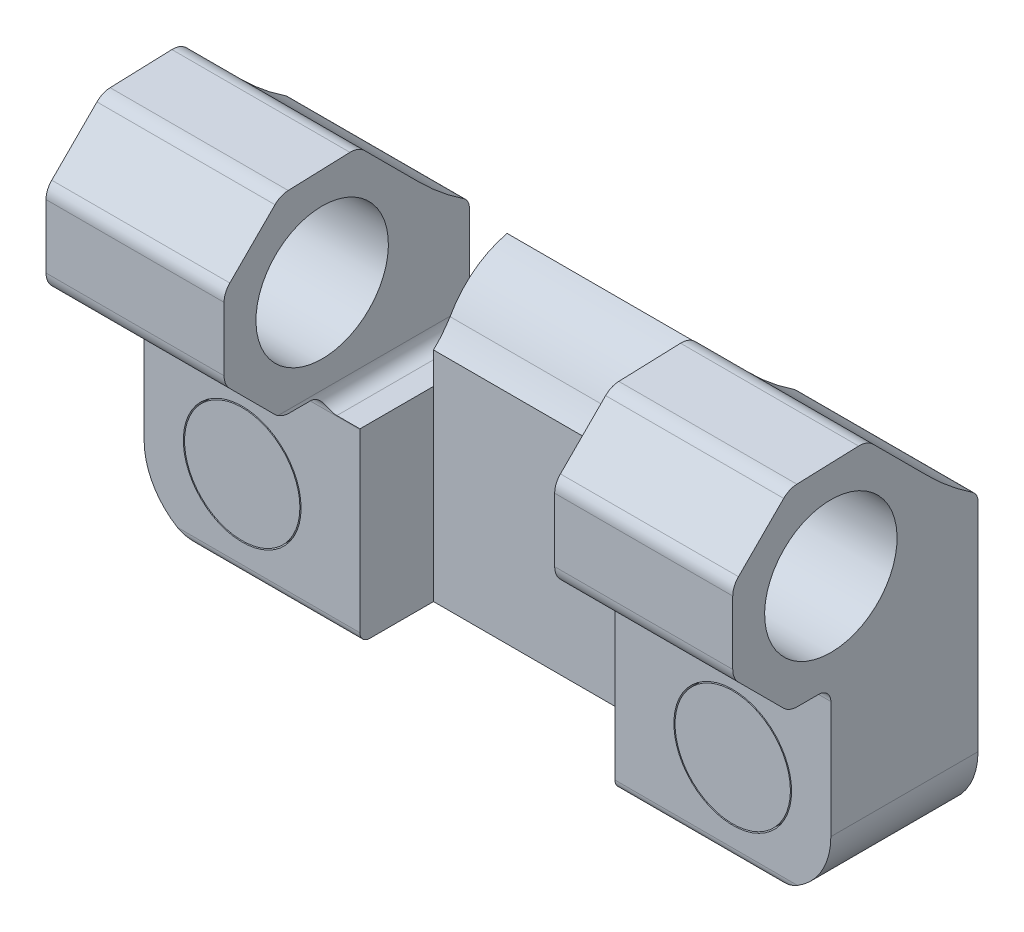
ISO-10303-21;
HEADER;
FILE_DESCRIPTION(('STEP AP214'),'2;1');
FILE_NAME('part.step','',(''),(''),'','','');
FILE_SCHEMA(('AUTOMOTIVE_DESIGN { 1 0 10303 214 1 1 1 1 }'));
ENDSEC;
DATA;
#1=APPLICATION_CONTEXT('core data for automotive mechanical design processes');
#2=APPLICATION_PROTOCOL_DEFINITION('international standard','automotive_design',2000,#1);
#3=PRODUCT_CONTEXT('',#1,'mechanical');
#4=PRODUCT('Part','Part','',(#3));
#5=PRODUCT_RELATED_PRODUCT_CATEGORY('part','',(#4));
#6=PRODUCT_DEFINITION_FORMATION('','',#4);
#7=PRODUCT_DEFINITION_CONTEXT('part definition',#1,'design');
#8=PRODUCT_DEFINITION('design','',#6,#7);
#9=PRODUCT_DEFINITION_SHAPE('','',#8);
#10=(LENGTH_UNIT() NAMED_UNIT(*) SI_UNIT(.MILLI.,.METRE.));
#11=(NAMED_UNIT(*) PLANE_ANGLE_UNIT() SI_UNIT($,.RADIAN.));
#12=(NAMED_UNIT(*) SI_UNIT($,.STERADIAN.) SOLID_ANGLE_UNIT());
#13=UNCERTAINTY_MEASURE_WITH_UNIT(LENGTH_MEASURE(1.E-05),#10,'distance_accuracy_value','');
#14=(GEOMETRIC_REPRESENTATION_CONTEXT(3) GLOBAL_UNCERTAINTY_ASSIGNED_CONTEXT((#13)) GLOBAL_UNIT_ASSIGNED_CONTEXT((#10,
#11,#12)) REPRESENTATION_CONTEXT('',''));
#15=CARTESIAN_POINT('',(0.,0.,0.));
#16=DIRECTION('',(0.,0.,1.));
#17=DIRECTION('',(1.,0.,0.));
#18=AXIS2_PLACEMENT_3D('',#15,#16,#17);
#19=CARTESIAN_POINT('',(-10.,29.0684889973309,12.0992960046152));
#20=DIRECTION('',(-1.,0.,0.));
#21=DIRECTION('',(0.,-1.,0.));
#22=AXIS2_PLACEMENT_3D('',#19,#20,#21);
#23=PLANE('',#22);
#24=DIRECTION('',(0.,-1.,0.));
#25=VECTOR('',#24,1.);
#26=CARTESIAN_POINT('',(-10.,20.1057282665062,0.));
#27=LINE('',#26,#25);
#28=CARTESIAN_POINT('',(-10.,20.1057282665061,0.));
#29=VERTEX_POINT('',#28);
#30=CARTESIAN_POINT('',(-10.,-2.00000000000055,0.));
#31=VERTEX_POINT('',#30);
#32=EDGE_CURVE('E877',#29,#31,#27,.T.);
#33=ORIENTED_EDGE('',*,*,#32,.T.);
#34=DIRECTION('',(0.,0.,-1.));
#35=VECTOR('',#34,1.);
#36=CARTESIAN_POINT('',(-10.,-2.00000000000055,35.));
#37=LINE('',#36,#35);
#38=CARTESIAN_POINT('',(-10.,-2.00000000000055,15.));
#39=VERTEX_POINT('',#38);
#40=EDGE_CURVE('E536',#39,#31,#37,.T.);
#41=ORIENTED_EDGE('',*,*,#40,.F.);
#42=DIRECTION('',(0.,1.,0.));
#43=VECTOR('',#42,1.);
#44=CARTESIAN_POINT('',(-10.,-8.,15.));
#45=LINE('',#44,#43);
#46=CARTESIAN_POINT('',(-10.,9.93,15.));
#47=VERTEX_POINT('',#46);
#48=EDGE_CURVE('E873',#39,#47,#45,.T.);
#49=ORIENTED_EDGE('',*,*,#48,.T.);
#50=CARTESIAN_POINT('',(-10.,9.92999999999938,16.2500000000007));
#51=DIRECTION('',(-1.,0.,0.));
#52=DIRECTION('',(0.,-1.,0.));
#53=AXIS2_PLACEMENT_3D('',#50,#51,#52);
#54=CIRCLE('',#53,1.25000000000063);
#55=CARTESIAN_POINT('',(-10.,11.18,16.2500000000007));
#56=VERTEX_POINT('',#55);
#57=EDGE_CURVE('E876',#56,#47,#54,.T.);
#58=ORIENTED_EDGE('',*,*,#57,.F.);
#59=DIRECTION('',(0.,0.,1.));
#60=VECTOR('',#59,1.);
#61=CARTESIAN_POINT('',(-10.,11.18,16.25));
#62=LINE('',#61,#60);
#63=CARTESIAN_POINT('',(-10.,11.18,18.421572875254));
#64=VERTEX_POINT('',#63);
#65=EDGE_CURVE('E879',#56,#64,#62,.T.);
#66=ORIENTED_EDGE('',*,*,#65,.T.);
#67=CARTESIAN_POINT('',(-10.,13.1800000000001,18.4215728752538));
#68=DIRECTION('',(-1.,0.,0.));
#69=DIRECTION('',(0.,-1.,0.));
#70=AXIS2_PLACEMENT_3D('',#67,#68,#69);
#71=CIRCLE('',#70,2.00000000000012);
#72=CARTESIAN_POINT('',(-10.,11.7657864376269,19.835786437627));
#73=VERTEX_POINT('',#72);
#74=EDGE_CURVE('E886',#64,#73,#71,.T.);
#75=ORIENTED_EDGE('',*,*,#74,.T.);
#76=DIRECTION('',(0.,0.707106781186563,0.707106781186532));
#77=VECTOR('',#76,1.);
#78=CARTESIAN_POINT('',(-10.,11.7657864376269,19.835786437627));
#79=LINE('',#78,#77);
#80=CARTESIAN_POINT('',(-10.,16.3442135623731,24.414213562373));
#81=VERTEX_POINT('',#80);
#82=EDGE_CURVE('E888',#73,#81,#79,.T.);
#83=ORIENTED_EDGE('',*,*,#82,.T.);
#84=CARTESIAN_POINT('',(-10.,17.7584271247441,23.0000000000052));
#85=DIRECTION('',(-1.,0.,0.));
#86=DIRECTION('',(0.,-1.,0.));
#87=AXIS2_PLACEMENT_3D('',#84,#85,#86);
#88=CIRCLE('',#87,1.99999999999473);
#89=CARTESIAN_POINT('',(-10.,17.7584271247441,25.));
#90=VERTEX_POINT('',#89);
#91=EDGE_CURVE('E890',#81,#90,#88,.T.);
#92=ORIENTED_EDGE('',*,*,#91,.T.);
#93=DIRECTION('',(0.,1.,0.));
#94=VECTOR('',#93,1.);
#95=CARTESIAN_POINT('',(-10.,17.7584271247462,25.));
#96=LINE('',#95,#94);
#97=CARTESIAN_POINT('',(-10.,24.2415728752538,25.));
#98=VERTEX_POINT('',#97);
#99=EDGE_CURVE('E678',#90,#98,#96,.T.);
#100=ORIENTED_EDGE('',*,*,#99,.T.);
#101=CARTESIAN_POINT('',(-10.,24.2415728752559,23.0000000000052));
#102=DIRECTION('',(-1.,0.,0.));
#103=DIRECTION('',(0.,-1.,0.));
#104=AXIS2_PLACEMENT_3D('',#101,#102,#103);
#105=CIRCLE('',#104,1.99999999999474);
#106=CARTESIAN_POINT('',(-10.,25.6557864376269,24.414213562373));
#107=VERTEX_POINT('',#106);
#108=EDGE_CURVE('E893',#98,#107,#105,.T.);
#109=ORIENTED_EDGE('',*,*,#108,.T.);
#110=DIRECTION('',(0.,0.707106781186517,-0.707106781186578));
#111=VECTOR('',#110,1.);
#112=CARTESIAN_POINT('',(-10.,25.6557864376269,24.414213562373));
#113=LINE('',#112,#111);
#114=CARTESIAN_POINT('',(-10.,30.2629264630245,19.807073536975));
#115=VERTEX_POINT('',#114);
#116=EDGE_CURVE('E894',#107,#115,#113,.T.);
#117=ORIENTED_EDGE('',*,*,#116,.T.);
#118=CARTESIAN_POINT('',(-10.,28.8487129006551,18.3928599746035));
#119=DIRECTION('',(-1.,0.,0.));
#120=DIRECTION('',(0.,-1.,0.));
#121=AXIS2_PLACEMENT_3D('',#118,#119,#120);
#122=CIRCLE('',#121,1.99999999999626);
#123=CARTESIAN_POINT('',(-10.,30.8474945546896,18.462658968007));
#124=VERTEX_POINT('',#123);
#125=EDGE_CURVE('E760',#115,#124,#122,.T.);
#126=ORIENTED_EDGE('',*,*,#125,.T.);
#127=DIRECTION('',(0.,0.0348994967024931,-0.999390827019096));
#128=VECTOR('',#127,1.);
#129=CARTESIAN_POINT('',(-10.,30.8474945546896,18.462658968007));
#130=LINE('',#129,#128);
#131=CARTESIAN_POINT('',(-10.,31.067270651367,12.169094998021));
#132=VERTEX_POINT('',#131);
#133=EDGE_CURVE('E801',#124,#132,#130,.T.);
#134=ORIENTED_EDGE('',*,*,#133,.T.);
#135=CARTESIAN_POINT('',(-10.,29.0684889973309,12.0992960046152));
#136=DIRECTION('',(-1.,0.,0.));
#137=DIRECTION('',(0.,-1.,0.));
#138=AXIS2_PLACEMENT_3D('',#135,#136,#137);
#139=CIRCLE('',#138,1.99999999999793);
#140=CARTESIAN_POINT('',(-10.,30.482702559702,10.685082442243));
#141=VERTEX_POINT('',#140);
#142=EDGE_CURVE('E903',#132,#141,#139,.T.);
#143=ORIENTED_EDGE('',*,*,#142,.T.);
#144=DIRECTION('',(0.,-0.707106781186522,-0.707106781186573));
#145=VECTOR('',#144,1.);
#146=CARTESIAN_POINT('',(-10.,30.482702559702,10.685082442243));
#147=LINE('',#146,#145);
#148=CARTESIAN_POINT('',(-10.,24.9695527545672,5.1719326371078));
#149=VERTEX_POINT('',#148);
#150=EDGE_CURVE('E904',#141,#149,#147,.T.);
#151=ORIENTED_EDGE('',*,*,#150,.T.);
#152=CARTESIAN_POINT('',(-10.,45.94,-15.9499999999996));
#153=DIRECTION('',(-1.,0.,0.));
#154=DIRECTION('',(0.,-1.,0.));
#155=AXIS2_PLACEMENT_3D('',#152,#153,#154);
#156=CIRCLE('',#155,29.7639999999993);
#157=CARTESIAN_POINT('',(-10.,21.1868689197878,0.578103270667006));
#158=VERTEX_POINT('',#157);
#159=EDGE_CURVE('E908',#158,#149,#156,.T.);
#160=ORIENTED_EDGE('',*,*,#159,.F.);
#161=CARTESIAN_POINT('',(-10.,20.1057282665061,1.30000000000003));
#162=DIRECTION('',(-1.,0.,0.));
#163=DIRECTION('',(0.,-1.,0.));
#164=AXIS2_PLACEMENT_3D('',#161,#162,#163);
#165=CIRCLE('',#164,1.30000000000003);
#166=EDGE_CURVE('E881',#158,#29,#165,.T.);
#167=ORIENTED_EDGE('',*,*,#166,.T.);
#168=EDGE_LOOP('',(#33,#41,#49,#58,#66,#75,#83,#92,#100,#109,#117,#126,#134,#143,#151,#160,#167));
#169=FACE_BOUND('',#168,.T.);
#170=CARTESIAN_POINT('',(-10.,21.,15.));
#171=DIRECTION('',(-1.,0.,0.));
#172=DIRECTION('',(0.,-1.,0.));
#173=AXIS2_PLACEMENT_3D('',#170,#171,#172);
#174=CIRCLE('',#173,6.75);
#175=CARTESIAN_POINT('',(-10.,14.25,15.));
#176=VERTEX_POINT('',#175);
#177=EDGE_CURVE('E1028',#176,#176,#174,.F.);
#178=ORIENTED_EDGE('',*,*,#177,.T.);
#179=EDGE_LOOP('',(#178));
#180=FACE_BOUND('',#179,.T.);
#181=ADVANCED_FACE('F16',(#169,#180),#23,.T.);
#182=CARTESIAN_POINT('',(60.,29.0684889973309,12.0992960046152));
#183=DIRECTION('',(-1.,0.,0.));
#184=DIRECTION('',(0.,-1.,0.));
#185=AXIS2_PLACEMENT_3D('',#182,#183,#184);
#186=PLANE('',#185);
#187=DIRECTION('',(0.,0.,-1.));
#188=VECTOR('',#187,1.);
#189=CARTESIAN_POINT('',(60.,-2.00000000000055,35.));
#190=LINE('',#189,#188);
#191=CARTESIAN_POINT('',(60.,-2.00000000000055,15.));
#192=VERTEX_POINT('',#191);
#193=CARTESIAN_POINT('',(60.,-2.00000000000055,0.));
#194=VERTEX_POINT('',#193);
#195=EDGE_CURVE('E543',#192,#194,#190,.T.);
#196=ORIENTED_EDGE('',*,*,#195,.T.);
#197=DIRECTION('',(0.,-1.,0.));
#198=VECTOR('',#197,1.);
#199=CARTESIAN_POINT('',(60.,20.1057282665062,0.));
#200=LINE('',#199,#198);
#201=CARTESIAN_POINT('',(60.,20.1057282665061,0.));
#202=VERTEX_POINT('',#201);
#203=EDGE_CURVE('E769',#202,#194,#200,.T.);
#204=ORIENTED_EDGE('',*,*,#203,.F.);
#205=CARTESIAN_POINT('',(60.,20.1057282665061,1.30000000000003));
#206=DIRECTION('',(-1.,0.,0.));
#207=DIRECTION('',(0.,-1.,0.));
#208=AXIS2_PLACEMENT_3D('',#205,#206,#207);
#209=CIRCLE('',#208,1.30000000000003);
#210=CARTESIAN_POINT('',(60.,21.1868689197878,0.578103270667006));
#211=VERTEX_POINT('',#210);
#212=EDGE_CURVE('E766',#211,#202,#209,.T.);
#213=ORIENTED_EDGE('',*,*,#212,.F.);
#214=CARTESIAN_POINT('',(60.,45.94,-15.9499999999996));
#215=DIRECTION('',(-1.,0.,0.));
#216=DIRECTION('',(0.,-1.,0.));
#217=AXIS2_PLACEMENT_3D('',#214,#215,#216);
#218=CIRCLE('',#217,29.7639999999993);
#219=CARTESIAN_POINT('',(60.,24.9695527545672,5.1719326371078));
#220=VERTEX_POINT('',#219);
#221=EDGE_CURVE('E764',#211,#220,#218,.T.);
#222=ORIENTED_EDGE('',*,*,#221,.T.);
#223=DIRECTION('',(0.,-0.707106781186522,-0.707106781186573));
#224=VECTOR('',#223,1.);
#225=CARTESIAN_POINT('',(60.,30.482702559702,10.685082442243));
#226=LINE('',#225,#224);
#227=CARTESIAN_POINT('',(60.,30.482702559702,10.685082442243));
#228=VERTEX_POINT('',#227);
#229=EDGE_CURVE('E752',#228,#220,#226,.T.);
#230=ORIENTED_EDGE('',*,*,#229,.F.);
#231=CARTESIAN_POINT('',(60.,29.0684889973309,12.0992960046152));
#232=DIRECTION('',(-1.,0.,0.));
#233=DIRECTION('',(0.,-1.,0.));
#234=AXIS2_PLACEMENT_3D('',#231,#232,#233);
#235=CIRCLE('',#234,1.99999999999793);
#236=CARTESIAN_POINT('',(60.,31.067270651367,12.169094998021));
#237=VERTEX_POINT('',#236);
#238=EDGE_CURVE('E740',#237,#228,#235,.T.);
#239=ORIENTED_EDGE('',*,*,#238,.F.);
#240=DIRECTION('',(0.,0.0348994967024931,-0.999390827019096));
#241=VECTOR('',#240,1.);
#242=CARTESIAN_POINT('',(60.,30.8474945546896,18.462658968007));
#243=LINE('',#242,#241);
#244=CARTESIAN_POINT('',(60.,30.8474945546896,18.462658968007));
#245=VERTEX_POINT('',#244);
#246=EDGE_CURVE('E749',#245,#237,#243,.T.);
#247=ORIENTED_EDGE('',*,*,#246,.F.);
#248=CARTESIAN_POINT('',(60.,28.8487129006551,18.3928599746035));
#249=DIRECTION('',(-1.,0.,0.));
#250=DIRECTION('',(0.,-1.,0.));
#251=AXIS2_PLACEMENT_3D('',#248,#249,#250);
#252=CIRCLE('',#251,1.99999999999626);
#253=CARTESIAN_POINT('',(60.,30.2629264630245,19.807073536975));
#254=VERTEX_POINT('',#253);
#255=EDGE_CURVE('E799',#254,#245,#252,.T.);
#256=ORIENTED_EDGE('',*,*,#255,.F.);
#257=DIRECTION('',(0.,0.707106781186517,-0.707106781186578));
#258=VECTOR('',#257,1.);
#259=CARTESIAN_POINT('',(60.,25.6557864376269,24.414213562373));
#260=LINE('',#259,#258);
#261=CARTESIAN_POINT('',(60.,25.6557864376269,24.414213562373));
#262=VERTEX_POINT('',#261);
#263=EDGE_CURVE('E796',#262,#254,#260,.T.);
#264=ORIENTED_EDGE('',*,*,#263,.F.);
#265=CARTESIAN_POINT('',(60.,24.2415728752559,23.0000000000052));
#266=DIRECTION('',(-1.,0.,0.));
#267=DIRECTION('',(0.,-1.,0.));
#268=AXIS2_PLACEMENT_3D('',#265,#266,#267);
#269=CIRCLE('',#268,1.99999999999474);
#270=CARTESIAN_POINT('',(60.,24.2415728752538,25.));
#271=VERTEX_POINT('',#270);
#272=EDGE_CURVE('E793',#271,#262,#269,.T.);
#273=ORIENTED_EDGE('',*,*,#272,.F.);
#274=DIRECTION('',(0.,1.,0.));
#275=VECTOR('',#274,1.);
#276=CARTESIAN_POINT('',(60.,17.7584271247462,25.));
#277=LINE('',#276,#275);
#278=CARTESIAN_POINT('',(60.,17.7584271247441,25.));
#279=VERTEX_POINT('',#278);
#280=EDGE_CURVE('E790',#279,#271,#277,.T.);
#281=ORIENTED_EDGE('',*,*,#280,.F.);
#282=CARTESIAN_POINT('',(60.,17.7584271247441,23.0000000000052));
#283=DIRECTION('',(-1.,0.,0.));
#284=DIRECTION('',(0.,-1.,0.));
#285=AXIS2_PLACEMENT_3D('',#282,#283,#284);
#286=CIRCLE('',#285,1.99999999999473);
#287=CARTESIAN_POINT('',(60.,16.3442135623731,24.414213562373));
#288=VERTEX_POINT('',#287);
#289=EDGE_CURVE('E787',#288,#279,#286,.T.);
#290=ORIENTED_EDGE('',*,*,#289,.F.);
#291=DIRECTION('',(0.,0.707106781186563,0.707106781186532));
#292=VECTOR('',#291,1.);
#293=CARTESIAN_POINT('',(60.,11.7657864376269,19.835786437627));
#294=LINE('',#293,#292);
#295=CARTESIAN_POINT('',(60.,11.7657864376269,19.835786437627));
#296=VERTEX_POINT('',#295);
#297=EDGE_CURVE('E784',#296,#288,#294,.T.);
#298=ORIENTED_EDGE('',*,*,#297,.F.);
#299=CARTESIAN_POINT('',(60.,13.1800000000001,18.4215728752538));
#300=DIRECTION('',(-1.,0.,0.));
#301=DIRECTION('',(0.,-1.,0.));
#302=AXIS2_PLACEMENT_3D('',#299,#300,#301);
#303=CIRCLE('',#302,2.00000000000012);
#304=CARTESIAN_POINT('',(60.,11.18,18.421572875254));
#305=VERTEX_POINT('',#304);
#306=EDGE_CURVE('E781',#305,#296,#303,.T.);
#307=ORIENTED_EDGE('',*,*,#306,.F.);
#308=DIRECTION('',(0.,0.,1.));
#309=VECTOR('',#308,1.);
#310=CARTESIAN_POINT('',(60.,11.18,16.25));
#311=LINE('',#310,#309);
#312=CARTESIAN_POINT('',(60.,11.18,16.2500000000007));
#313=VERTEX_POINT('',#312);
#314=EDGE_CURVE('E778',#313,#305,#311,.T.);
#315=ORIENTED_EDGE('',*,*,#314,.F.);
#316=CARTESIAN_POINT('',(60.,9.92999999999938,16.2500000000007));
#317=DIRECTION('',(-1.,0.,0.));
#318=DIRECTION('',(0.,-1.,0.));
#319=AXIS2_PLACEMENT_3D('',#316,#317,#318);
#320=CIRCLE('',#319,1.25000000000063);
#321=CARTESIAN_POINT('',(60.,9.93,15.));
#322=VERTEX_POINT('',#321);
#323=EDGE_CURVE('E775',#313,#322,#320,.T.);
#324=ORIENTED_EDGE('',*,*,#323,.T.);
#325=DIRECTION('',(0.,1.,0.));
#326=VECTOR('',#325,1.);
#327=CARTESIAN_POINT('',(60.,-8.,15.));
#328=LINE('',#327,#326);
#329=EDGE_CURVE('E772',#192,#322,#328,.T.);
#330=ORIENTED_EDGE('',*,*,#329,.F.);
#331=EDGE_LOOP('',(#196,#204,#213,#222,#230,#239,#247,#256,#264,#273,#281,#290,#298,#307,#315,
#324,#330));
#332=FACE_BOUND('',#331,.T.);
#333=CARTESIAN_POINT('',(60.,21.,15.));
#334=DIRECTION('',(-1.,0.,0.));
#335=DIRECTION('',(0.,-1.,0.));
#336=AXIS2_PLACEMENT_3D('',#333,#334,#335);
#337=CIRCLE('',#336,6.75);
#338=CARTESIAN_POINT('',(60.,14.25,15.));
#339=VERTEX_POINT('',#338);
#340=EDGE_CURVE('E1033',#339,#339,#337,.F.);
#341=ORIENTED_EDGE('',*,*,#340,.F.);
#342=EDGE_LOOP('',(#341));
#343=FACE_BOUND('',#342,.T.);
#344=ADVANCED_FACE('F618',(#332,#343),#186,.F.);
#345=CARTESIAN_POINT('',(41.85,11.5,26.));
#346=DIRECTION('',(-1.,0.,0.));
#347=DIRECTION('',(0.,-1.,0.));
#348=AXIS2_PLACEMENT_3D('',#345,#346,#347);
#349=PLANE('',#348);
#350=CARTESIAN_POINT('',(41.85,20.1057282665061,1.30000000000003));
#351=DIRECTION('',(-1.,0.,0.));
#352=DIRECTION('',(0.,-1.,0.));
#353=AXIS2_PLACEMENT_3D('',#350,#351,#352);
#354=CIRCLE('',#353,1.30000000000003);
#355=CARTESIAN_POINT('',(41.85,21.1868689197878,0.578103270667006));
#356=VERTEX_POINT('',#355);
#357=CARTESIAN_POINT('',(41.85,20.1057282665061,0.));
#358=VERTEX_POINT('',#357);
#359=EDGE_CURVE('E466',#356,#358,#354,.T.);
#360=ORIENTED_EDGE('',*,*,#359,.T.);
#361=DIRECTION('',(0.,1.,0.));
#362=VECTOR('',#361,1.);
#363=CARTESIAN_POINT('',(41.85,11.5,0.));
#364=LINE('',#363,#362);
#365=CARTESIAN_POINT('',(41.85,11.4999999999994,0.));
#366=VERTEX_POINT('',#365);
#367=EDGE_CURVE('E372',#366,#358,#364,.T.);
#368=ORIENTED_EDGE('',*,*,#367,.F.);
#369=DIRECTION('',(0.,0.,-1.));
#370=VECTOR('',#369,1.);
#371=CARTESIAN_POINT('',(41.85,11.4999999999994,26.));
#372=LINE('',#371,#370);
#373=CARTESIAN_POINT('',(41.85,11.4999999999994,19.506745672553));
#374=VERTEX_POINT('',#373);
#375=EDGE_CURVE('E375',#374,#366,#372,.T.);
#376=ORIENTED_EDGE('',*,*,#375,.F.);
#377=CARTESIAN_POINT('',(41.85,13.1800000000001,18.4215728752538));
#378=DIRECTION('',(-1.,0.,0.));
#379=DIRECTION('',(0.,-1.,0.));
#380=AXIS2_PLACEMENT_3D('',#377,#378,#379);
#381=CIRCLE('',#380,2.00000000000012);
#382=CARTESIAN_POINT('',(41.85,11.7657864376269,19.835786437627));
#383=VERTEX_POINT('',#382);
#384=EDGE_CURVE('E836',#374,#383,#381,.T.);
#385=ORIENTED_EDGE('',*,*,#384,.T.);
#386=DIRECTION('',(0.,0.707106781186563,0.707106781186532));
#387=VECTOR('',#386,1.);
#388=CARTESIAN_POINT('',(41.85,11.7657864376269,19.835786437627));
#389=LINE('',#388,#387);
#390=CARTESIAN_POINT('',(41.85,16.3442135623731,24.414213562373));
#391=VERTEX_POINT('',#390);
#392=EDGE_CURVE('E834',#383,#391,#389,.T.);
#393=ORIENTED_EDGE('',*,*,#392,.T.);
#394=CARTESIAN_POINT('',(41.85,17.7584271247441,23.0000000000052));
#395=DIRECTION('',(-1.,0.,0.));
#396=DIRECTION('',(0.,-1.,0.));
#397=AXIS2_PLACEMENT_3D('',#394,#395,#396);
#398=CIRCLE('',#397,1.99999999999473);
#399=CARTESIAN_POINT('',(41.85,17.7584271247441,25.));
#400=VERTEX_POINT('',#399);
#401=EDGE_CURVE('E832',#391,#400,#398,.T.);
#402=ORIENTED_EDGE('',*,*,#401,.T.);
#403=DIRECTION('',(0.,1.,0.));
#404=VECTOR('',#403,1.);
#405=CARTESIAN_POINT('',(41.85,17.7584271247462,25.));
#406=LINE('',#405,#404);
#407=CARTESIAN_POINT('',(41.85,24.2415728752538,25.));
#408=VERTEX_POINT('',#407);
#409=EDGE_CURVE('E828',#400,#408,#406,.T.);
#410=ORIENTED_EDGE('',*,*,#409,.T.);
#411=CARTESIAN_POINT('',(41.85,24.2415728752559,23.0000000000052));
#412=DIRECTION('',(-1.,0.,0.));
#413=DIRECTION('',(0.,-1.,0.));
#414=AXIS2_PLACEMENT_3D('',#411,#412,#413);
#415=CIRCLE('',#414,1.99999999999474);
#416=CARTESIAN_POINT('',(41.85,25.6557864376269,24.414213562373));
#417=VERTEX_POINT('',#416);
#418=EDGE_CURVE('E827',#408,#417,#415,.T.);
#419=ORIENTED_EDGE('',*,*,#418,.T.);
#420=DIRECTION('',(0.,0.707106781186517,-0.707106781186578));
#421=VECTOR('',#420,1.);
#422=CARTESIAN_POINT('',(41.85,25.6557864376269,24.414213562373));
#423=LINE('',#422,#421);
#424=CARTESIAN_POINT('',(41.85,30.2629264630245,19.807073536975));
#425=VERTEX_POINT('',#424);
#426=EDGE_CURVE('E820',#417,#425,#423,.T.);
#427=ORIENTED_EDGE('',*,*,#426,.T.);
#428=CARTESIAN_POINT('',(41.85,28.8487129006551,18.3928599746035));
#429=DIRECTION('',(-1.,0.,0.));
#430=DIRECTION('',(0.,-1.,0.));
#431=AXIS2_PLACEMENT_3D('',#428,#429,#430);
#432=CIRCLE('',#431,1.99999999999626);
#433=CARTESIAN_POINT('',(41.85,30.8474945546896,18.462658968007));
#434=VERTEX_POINT('',#433);
#435=EDGE_CURVE('E423',#425,#434,#432,.T.);
#436=ORIENTED_EDGE('',*,*,#435,.T.);
#437=DIRECTION('',(0.,0.0348994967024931,-0.999390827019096));
#438=VECTOR('',#437,1.);
#439=CARTESIAN_POINT('',(41.85,30.8474945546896,18.462658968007));
#440=LINE('',#439,#438);
#441=CARTESIAN_POINT('',(41.85,31.067270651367,12.169094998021));
#442=VERTEX_POINT('',#441);
#443=EDGE_CURVE('E838',#434,#442,#440,.T.);
#444=ORIENTED_EDGE('',*,*,#443,.T.);
#445=CARTESIAN_POINT('',(41.85,29.0684889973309,12.0992960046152));
#446=DIRECTION('',(-1.,0.,0.));
#447=DIRECTION('',(0.,-1.,0.));
#448=AXIS2_PLACEMENT_3D('',#445,#446,#447);
#449=CIRCLE('',#448,1.99999999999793);
#450=CARTESIAN_POINT('',(41.85,30.482702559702,10.685082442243));
#451=VERTEX_POINT('',#450);
#452=EDGE_CURVE('E742',#442,#451,#449,.T.);
#453=ORIENTED_EDGE('',*,*,#452,.T.);
#454=DIRECTION('',(0.,-0.707106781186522,-0.707106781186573));
#455=VECTOR('',#454,1.);
#456=CARTESIAN_POINT('',(41.85,30.482702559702,10.685082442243));
#457=LINE('',#456,#455);
#458=CARTESIAN_POINT('',(41.85,24.9695527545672,5.1719326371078));
#459=VERTEX_POINT('',#458);
#460=EDGE_CURVE('E841',#451,#459,#457,.T.);
#461=ORIENTED_EDGE('',*,*,#460,.T.);
#462=CARTESIAN_POINT('',(41.85,45.94,-15.9499999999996));
#463=DIRECTION('',(-1.,0.,0.));
#464=DIRECTION('',(0.,-1.,0.));
#465=AXIS2_PLACEMENT_3D('',#462,#463,#464);
#466=CIRCLE('',#465,29.7639999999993);
#467=EDGE_CURVE('E842',#356,#459,#466,.T.);
#468=ORIENTED_EDGE('',*,*,#467,.F.);
#469=EDGE_LOOP('',(#360,#368,#376,#385,#393,#402,#410,#419,#427,#436,#444,#453,#461,#468));
#470=FACE_BOUND('',#469,.T.);
#471=CARTESIAN_POINT('',(41.85,21.,15.));
#472=DIRECTION('',(-1.,0.,0.));
#473=DIRECTION('',(0.,-1.,0.));
#474=AXIS2_PLACEMENT_3D('',#471,#472,#473);
#475=CIRCLE('',#474,6.75);
#476=CARTESIAN_POINT('',(41.85,14.25,15.));
#477=VERTEX_POINT('',#476);
#478=EDGE_CURVE('E1031',#477,#477,#475,.F.);
#479=ORIENTED_EDGE('',*,*,#478,.T.);
#480=EDGE_LOOP('',(#479));
#481=FACE_BOUND('',#480,.T.);
#482=ADVANCED_FACE('F476',(#470,#481),#349,.T.);
#483=CARTESIAN_POINT('',(8.15,40.,26.));
#484=DIRECTION('',(1.,0.,0.));
#485=DIRECTION('',(0.,1.,0.));
#486=AXIS2_PLACEMENT_3D('',#483,#484,#485);
#487=PLANE('',#486);
#488=CARTESIAN_POINT('',(8.15,20.1057282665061,1.30000000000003));
#489=DIRECTION('',(1.,0.,0.));
#490=DIRECTION('',(0.,1.,0.));
#491=AXIS2_PLACEMENT_3D('',#488,#489,#490);
#492=CIRCLE('',#491,1.30000000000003);
#493=CARTESIAN_POINT('',(8.15,20.1057282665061,0.));
#494=VERTEX_POINT('',#493);
#495=CARTESIAN_POINT('',(8.15,21.1868689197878,0.578103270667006));
#496=VERTEX_POINT('',#495);
#497=EDGE_CURVE('E410',#494,#496,#492,.T.);
#498=ORIENTED_EDGE('',*,*,#497,.T.);
#499=CARTESIAN_POINT('',(8.15,45.94,-15.9499999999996));
#500=DIRECTION('',(1.,0.,0.));
#501=DIRECTION('',(0.,1.,0.));
#502=AXIS2_PLACEMENT_3D('',#499,#500,#501);
#503=CIRCLE('',#502,29.7639999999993);
#504=CARTESIAN_POINT('',(8.15,24.9695527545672,5.1719326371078));
#505=VERTEX_POINT('',#504);
#506=EDGE_CURVE('E407',#505,#496,#503,.T.);
#507=ORIENTED_EDGE('',*,*,#506,.F.);
#508=DIRECTION('',(0.,0.707106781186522,0.707106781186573));
#509=VECTOR('',#508,1.);
#510=CARTESIAN_POINT('',(8.15,30.482702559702,10.685082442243));
#511=LINE('',#510,#509);
#512=CARTESIAN_POINT('',(8.15,30.482702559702,10.685082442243));
#513=VERTEX_POINT('',#512);
#514=EDGE_CURVE('E405',#505,#513,#511,.T.);
#515=ORIENTED_EDGE('',*,*,#514,.T.);
#516=CARTESIAN_POINT('',(8.15,29.0684889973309,12.0992960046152));
#517=DIRECTION('',(1.,0.,0.));
#518=DIRECTION('',(0.,1.,0.));
#519=AXIS2_PLACEMENT_3D('',#516,#517,#518);
#520=CIRCLE('',#519,1.99999999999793);
#521=CARTESIAN_POINT('',(8.15,31.067270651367,12.169094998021));
#522=VERTEX_POINT('',#521);
#523=EDGE_CURVE('E403',#513,#522,#520,.T.);
#524=ORIENTED_EDGE('',*,*,#523,.T.);
#525=DIRECTION('',(0.,-0.0348994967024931,0.999390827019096));
#526=VECTOR('',#525,1.);
#527=CARTESIAN_POINT('',(8.15,30.8474945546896,18.462658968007));
#528=LINE('',#527,#526);
#529=CARTESIAN_POINT('',(8.15,30.8474945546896,18.462658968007));
#530=VERTEX_POINT('',#529);
#531=EDGE_CURVE('E401',#522,#530,#528,.T.);
#532=ORIENTED_EDGE('',*,*,#531,.T.);
#533=CARTESIAN_POINT('',(8.15,28.8487129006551,18.3928599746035));
#534=DIRECTION('',(1.,0.,0.));
#535=DIRECTION('',(0.,1.,0.));
#536=AXIS2_PLACEMENT_3D('',#533,#534,#535);
#537=CIRCLE('',#536,1.99999999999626);
#538=CARTESIAN_POINT('',(8.15,30.2629264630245,19.807073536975));
#539=VERTEX_POINT('',#538);
#540=EDGE_CURVE('E25',#530,#539,#537,.T.);
#541=ORIENTED_EDGE('',*,*,#540,.T.);
#542=DIRECTION('',(0.,-0.707106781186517,0.707106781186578));
#543=VECTOR('',#542,1.);
#544=CARTESIAN_POINT('',(8.15,25.6557864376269,24.414213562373));
#545=LINE('',#544,#543);
#546=CARTESIAN_POINT('',(8.15,25.6557864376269,24.414213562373));
#547=VERTEX_POINT('',#546);
#548=EDGE_CURVE('E390',#539,#547,#545,.T.);
#549=ORIENTED_EDGE('',*,*,#548,.T.);
#550=CARTESIAN_POINT('',(8.15,24.2415728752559,23.0000000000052));
#551=DIRECTION('',(1.,0.,0.));
#552=DIRECTION('',(0.,1.,0.));
#553=AXIS2_PLACEMENT_3D('',#550,#551,#552);
#554=CIRCLE('',#553,1.99999999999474);
#555=CARTESIAN_POINT('',(8.15,24.2415728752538,25.));
#556=VERTEX_POINT('',#555);
#557=EDGE_CURVE('E392',#547,#556,#554,.T.);
#558=ORIENTED_EDGE('',*,*,#557,.T.);
#559=DIRECTION('',(0.,-1.,0.));
#560=VECTOR('',#559,1.);
#561=CARTESIAN_POINT('',(8.15,17.7584271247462,25.));
#562=LINE('',#561,#560);
#563=CARTESIAN_POINT('',(8.15,17.7584271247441,25.));
#564=VERTEX_POINT('',#563);
#565=EDGE_CURVE('E394',#556,#564,#562,.T.);
#566=ORIENTED_EDGE('',*,*,#565,.T.);
#567=CARTESIAN_POINT('',(8.15,17.7584271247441,23.0000000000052));
#568=DIRECTION('',(1.,0.,0.));
#569=DIRECTION('',(0.,1.,0.));
#570=AXIS2_PLACEMENT_3D('',#567,#568,#569);
#571=CIRCLE('',#570,1.99999999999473);
#572=CARTESIAN_POINT('',(8.15,16.3442135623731,24.414213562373));
#573=VERTEX_POINT('',#572);
#574=EDGE_CURVE('E396',#564,#573,#571,.T.);
#575=ORIENTED_EDGE('',*,*,#574,.T.);
#576=DIRECTION('',(0.,-0.707106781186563,-0.707106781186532));
#577=VECTOR('',#576,1.);
#578=CARTESIAN_POINT('',(8.15,11.7657864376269,19.835786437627));
#579=LINE('',#578,#577);
#580=CARTESIAN_POINT('',(8.15,11.7657864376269,19.835786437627));
#581=VERTEX_POINT('',#580);
#582=EDGE_CURVE('E398',#573,#581,#579,.T.);
#583=ORIENTED_EDGE('',*,*,#582,.T.);
#584=CARTESIAN_POINT('',(8.15,13.1800000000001,18.4215728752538));
#585=DIRECTION('',(1.,0.,0.));
#586=DIRECTION('',(0.,1.,0.));
#587=AXIS2_PLACEMENT_3D('',#584,#585,#586);
#588=CIRCLE('',#587,2.00000000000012);
#589=CARTESIAN_POINT('',(8.15,11.5,19.5067456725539));
#590=VERTEX_POINT('',#589);
#591=EDGE_CURVE('E329',#581,#590,#588,.T.);
#592=ORIENTED_EDGE('',*,*,#591,.T.);
#593=DIRECTION('',(0.,0.,-1.));
#594=VECTOR('',#593,1.);
#595=CARTESIAN_POINT('',(8.15,11.5,26.));
#596=LINE('',#595,#594);
#597=CARTESIAN_POINT('',(8.15,11.5,0.));
#598=VERTEX_POINT('',#597);
#599=EDGE_CURVE('E321',#590,#598,#596,.T.);
#600=ORIENTED_EDGE('',*,*,#599,.T.);
#601=DIRECTION('',(0.,-1.,0.));
#602=VECTOR('',#601,1.);
#603=CARTESIAN_POINT('',(8.15,40.,0.));
#604=LINE('',#603,#602);
#605=EDGE_CURVE('E326',#494,#598,#604,.T.);
#606=ORIENTED_EDGE('',*,*,#605,.F.);
#607=EDGE_LOOP('',(#498,#507,#515,#524,#532,#541,#549,#558,#566,#575,#583,#592,#600,#606));
#608=FACE_BOUND('',#607,.T.);
#609=CARTESIAN_POINT('',(8.15,21.,15.));
#610=DIRECTION('',(1.,0.,0.));
#611=DIRECTION('',(0.,1.,0.));
#612=AXIS2_PLACEMENT_3D('',#609,#610,#611);
#613=CIRCLE('',#612,6.75);
#614=CARTESIAN_POINT('',(8.15,27.75,15.));
#615=VERTEX_POINT('',#614);
#616=EDGE_CURVE('E20',#615,#615,#613,.F.);
#617=ORIENTED_EDGE('',*,*,#616,.T.);
#618=EDGE_LOOP('',(#617));
#619=FACE_BOUND('',#618,.T.);
#620=ADVANCED_FACE('F323',(#608,#619),#487,.T.);
#621=CARTESIAN_POINT('',(-10.,20.1057282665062,0.));
#622=DIRECTION('',(0.,0.,1.));
#623=DIRECTION('',(-1.,0.,0.));
#624=AXIS2_PLACEMENT_3D('',#621,#622,#623);
#625=PLANE('',#624);
#626=CARTESIAN_POINT('',(0.,0.,0.));
#627=DIRECTION('',(0.,0.,1.));
#628=DIRECTION('',(-1.,0.,0.));
#629=AXIS2_PLACEMENT_3D('',#626,#627,#628);
#630=CIRCLE('',#629,3.25);
#631=CARTESIAN_POINT('',(-3.25,0.,0.));
#632=VERTEX_POINT('',#631);
#633=EDGE_CURVE('E1054',#632,#632,#630,.T.);
#634=ORIENTED_EDGE('',*,*,#633,.T.);
#635=EDGE_LOOP('',(#634));
#636=FACE_BOUND('',#635,.T.);
#637=ORIENTED_EDGE('',*,*,#605,.T.);
#638=CARTESIAN_POINT('',(9.6499999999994,11.4999999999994,0.));
#639=DIRECTION('',(0.,0.,1.));
#640=DIRECTION('',(0.,-1.,0.));
#641=AXIS2_PLACEMENT_3D('',#638,#639,#640);
#642=CIRCLE('',#641,1.4999999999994);
#643=CARTESIAN_POINT('',(9.6499999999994,10.,0.));
#644=VERTEX_POINT('',#643);
#645=EDGE_CURVE('E336',#598,#644,#642,.T.);
#646=ORIENTED_EDGE('',*,*,#645,.T.);
#647=DIRECTION('',(1.,0.,0.));
#648=VECTOR('',#647,1.);
#649=CARTESIAN_POINT('',(9.65,10.,0.));
#650=LINE('',#649,#648);
#651=CARTESIAN_POINT('',(12.,10.,0.));
#652=VERTEX_POINT('',#651);
#653=EDGE_CURVE('E342',#644,#652,#650,.T.);
#654=ORIENTED_EDGE('',*,*,#653,.T.);
#655=DIRECTION('',(0.,1.,0.));
#656=VECTOR('',#655,1.);
#657=CARTESIAN_POINT('',(12.,10.,0.));
#658=LINE('',#657,#656);
#659=CARTESIAN_POINT('',(12.,19.7557884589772,0.));
#660=VERTEX_POINT('',#659);
#661=EDGE_CURVE('E360',#652,#660,#658,.T.);
#662=ORIENTED_EDGE('',*,*,#661,.T.);
#663=DIRECTION('',(1.,0.,0.));
#664=VECTOR('',#663,1.);
#665=CARTESIAN_POINT('',(12.,19.7557884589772,0.));
#666=LINE('',#665,#664);
#667=CARTESIAN_POINT('',(38.,19.7557884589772,0.));
#668=VERTEX_POINT('',#667);
#669=EDGE_CURVE('E518',#660,#668,#666,.T.);
#670=ORIENTED_EDGE('',*,*,#669,.T.);
#671=DIRECTION('',(0.,-1.,0.));
#672=VECTOR('',#671,1.);
#673=CARTESIAN_POINT('',(38.,35.,0.));
#674=LINE('',#673,#672);
#675=CARTESIAN_POINT('',(38.,10.,0.));
#676=VERTEX_POINT('',#675);
#677=EDGE_CURVE('E363',#668,#676,#674,.T.);
#678=ORIENTED_EDGE('',*,*,#677,.T.);
#679=DIRECTION('',(1.,0.,0.));
#680=VECTOR('',#679,1.);
#681=CARTESIAN_POINT('',(38.,10.,0.));
#682=LINE('',#681,#680);
#683=CARTESIAN_POINT('',(40.35,10.,0.));
#684=VERTEX_POINT('',#683);
#685=EDGE_CURVE('E366',#676,#684,#682,.T.);
#686=ORIENTED_EDGE('',*,*,#685,.T.);
#687=CARTESIAN_POINT('',(40.3500000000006,11.4999999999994,0.));
#688=DIRECTION('',(0.,0.,1.));
#689=DIRECTION('',(0.,-1.,0.));
#690=AXIS2_PLACEMENT_3D('',#687,#688,#689);
#691=CIRCLE('',#690,1.49999999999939);
#692=EDGE_CURVE('E369',#684,#366,#691,.T.);
#693=ORIENTED_EDGE('',*,*,#692,.T.);
#694=ORIENTED_EDGE('',*,*,#367,.T.);
#695=DIRECTION('',(1.,0.,0.));
#696=VECTOR('',#695,1.);
#697=CARTESIAN_POINT('',(-10.,20.1057282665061,0.));
#698=LINE('',#697,#696);
#699=EDGE_CURVE('E714',#358,#202,#698,.T.);
#700=ORIENTED_EDGE('',*,*,#699,.T.);
#701=ORIENTED_EDGE('',*,*,#203,.T.);
#702=CARTESIAN_POINT('',(53.0000000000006,-2.00000000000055,0.));
#703=DIRECTION('',(0.,0.,1.));
#704=DIRECTION('',(-1.,0.,0.));
#705=AXIS2_PLACEMENT_3D('',#702,#703,#704);
#706=CIRCLE('',#705,6.99999999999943);
#707=CARTESIAN_POINT('',(53.0000000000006,-9.,0.));
#708=VERTEX_POINT('',#707);
#709=EDGE_CURVE('E558',#194,#708,#706,.F.);
#710=ORIENTED_EDGE('',*,*,#709,.T.);
#711=DIRECTION('',(1.,0.,0.));
#712=VECTOR('',#711,1.);
#713=CARTESIAN_POINT('',(-10.,-9.,0.));
#714=LINE('',#713,#712);
#715=CARTESIAN_POINT('',(-3.,-9.,0.));
#716=VERTEX_POINT('',#715);
#717=EDGE_CURVE('E711',#716,#708,#714,.T.);
#718=ORIENTED_EDGE('',*,*,#717,.F.);
#719=CARTESIAN_POINT('',(-3.0000000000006,-2.00000000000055,0.));
#720=DIRECTION('',(0.,0.,1.));
#721=DIRECTION('',(-1.,0.,0.));
#722=AXIS2_PLACEMENT_3D('',#719,#720,#721);
#723=CIRCLE('',#722,6.99999999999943);
#724=EDGE_CURVE('E582',#716,#31,#723,.F.);
#725=ORIENTED_EDGE('',*,*,#724,.T.);
#726=ORIENTED_EDGE('',*,*,#32,.F.);
#727=EDGE_CURVE('E349',#29,#494,#698,.T.);
#728=ORIENTED_EDGE('',*,*,#727,.T.);
#729=EDGE_LOOP('',(#637,#646,#654,#662,#670,#678,#686,#693,#694,#700,#701,#710,#718,#725,#726,#728));
#730=FACE_BOUND('',#729,.T.);
#731=CARTESIAN_POINT('',(50.,0.,0.));
#732=DIRECTION('',(0.,0.,1.));
#733=DIRECTION('',(-1.,0.,0.));
#734=AXIS2_PLACEMENT_3D('',#731,#732,#733);
#735=CIRCLE('',#734,3.25);
#736=CARTESIAN_POINT('',(46.75,0.,0.));
#737=VERTEX_POINT('',#736);
#738=EDGE_CURVE('E1046',#737,#737,#735,.T.);
#739=ORIENTED_EDGE('',*,*,#738,.T.);
#740=EDGE_LOOP('',(#739));
#741=FACE_BOUND('',#740,.T.);
#742=ADVANCED_FACE('F345',(#636,#730,#741),#625,.F.);
#743=CARTESIAN_POINT('',(-10.,-8.,15.));
#744=DIRECTION('',(0.,0.,-1.));
#745=DIRECTION('',(1.,0.,0.));
#746=AXIS2_PLACEMENT_3D('',#743,#744,#745);
#747=PLANE('',#746);
#748=DIRECTION('',(0.,1.,0.));
#749=VECTOR('',#748,1.);
#750=CARTESIAN_POINT('',(38.,-8.,15.));
#751=LINE('',#750,#749);
#752=CARTESIAN_POINT('',(38.,-8.00000000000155,15.));
#753=VERTEX_POINT('',#752);
#754=CARTESIAN_POINT('',(38.,9.93,15.));
#755=VERTEX_POINT('',#754);
#756=EDGE_CURVE('E523',#753,#755,#751,.T.);
#757=ORIENTED_EDGE('',*,*,#756,.F.);
#758=DIRECTION('',(1.,0.,0.));
#759=VECTOR('',#758,1.);
#760=CARTESIAN_POINT('',(-10.,-8.00000000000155,15.));
#761=LINE('',#760,#759);
#762=CARTESIAN_POINT('',(56.6055512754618,-8.00000000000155,15.));
#763=VERTEX_POINT('',#762);
#764=EDGE_CURVE('E703',#753,#763,#761,.T.);
#765=ORIENTED_EDGE('',*,*,#764,.T.);
#766=CARTESIAN_POINT('',(53.0000000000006,-2.00000000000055,15.));
#767=DIRECTION('',(0.,0.,-1.));
#768=DIRECTION('',(1.,0.,0.));
#769=AXIS2_PLACEMENT_3D('',#766,#767,#768);
#770=CIRCLE('',#769,6.99999999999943);
#771=EDGE_CURVE('E546',#763,#192,#770,.F.);
#772=ORIENTED_EDGE('',*,*,#771,.T.);
#773=ORIENTED_EDGE('',*,*,#329,.T.);
#774=DIRECTION('',(1.,0.,0.));
#775=VECTOR('',#774,1.);
#776=CARTESIAN_POINT('',(-10.,9.93,15.));
#777=LINE('',#776,#775);
#778=EDGE_CURVE('E699',#755,#322,#777,.T.);
#779=ORIENTED_EDGE('',*,*,#778,.F.);
#780=EDGE_LOOP('',(#757,#765,#772,#773,#779));
#781=FACE_BOUND('',#780,.T.);
#782=CARTESIAN_POINT('',(50.,0.,15.));
#783=DIRECTION('',(0.,0.,-1.));
#784=DIRECTION('',(1.,0.,0.));
#785=AXIS2_PLACEMENT_3D('',#782,#783,#784);
#786=CIRCLE('',#785,6.);
#787=CARTESIAN_POINT('',(56.,0.,15.));
#788=VERTEX_POINT('',#787);
#789=EDGE_CURVE('E1062',#788,#788,#786,.F.);
#790=ORIENTED_EDGE('',*,*,#789,.F.);
#791=EDGE_LOOP('',(#790));
#792=FACE_BOUND('',#791,.T.);
#793=ADVANCED_FACE('F943',(#781,#792),#747,.F.);
#794=CARTESIAN_POINT('',(-6.60555127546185,-8.00000000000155,15.));
#795=VERTEX_POINT('',#794);
#796=CARTESIAN_POINT('',(12.,-8.00000000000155,15.));
#797=VERTEX_POINT('',#796);
#798=EDGE_CURVE('E704',#795,#797,#761,.T.);
#799=ORIENTED_EDGE('',*,*,#798,.T.);
#800=DIRECTION('',(0.,1.,0.));
#801=VECTOR('',#800,1.);
#802=CARTESIAN_POINT('',(12.,-8.,15.));
#803=LINE('',#802,#801);
#804=CARTESIAN_POINT('',(12.,9.93,15.));
#805=VERTEX_POINT('',#804);
#806=EDGE_CURVE('E530',#797,#805,#803,.T.);
#807=ORIENTED_EDGE('',*,*,#806,.T.);
#808=EDGE_CURVE('E700',#47,#805,#777,.T.);
#809=ORIENTED_EDGE('',*,*,#808,.F.);
#810=ORIENTED_EDGE('',*,*,#48,.F.);
#811=CARTESIAN_POINT('',(-3.0000000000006,-2.00000000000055,15.));
#812=DIRECTION('',(0.,0.,-1.));
#813=DIRECTION('',(1.,0.,0.));
#814=AXIS2_PLACEMENT_3D('',#811,#812,#813);
#815=CIRCLE('',#814,6.99999999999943);
#816=EDGE_CURVE('E41',#39,#795,#815,.F.);
#817=ORIENTED_EDGE('',*,*,#816,.T.);
#818=EDGE_LOOP('',(#799,#807,#809,#810,#817));
#819=FACE_BOUND('',#818,.T.);
#820=CARTESIAN_POINT('',(0.,0.,15.));
#821=DIRECTION('',(0.,0.,-1.));
#822=DIRECTION('',(1.,0.,0.));
#823=AXIS2_PLACEMENT_3D('',#820,#821,#822);
#824=CIRCLE('',#823,6.);
#825=CARTESIAN_POINT('',(6.,0.,15.));
#826=VERTEX_POINT('',#825);
#827=EDGE_CURVE('E353',#826,#826,#824,.F.);
#828=ORIENTED_EDGE('',*,*,#827,.F.);
#829=EDGE_LOOP('',(#828));
#830=FACE_BOUND('',#829,.T.);
#831=ADVANCED_FACE('F869',(#819,#830),#747,.F.);
#832=CARTESIAN_POINT('',(-10.,30.8474945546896,18.462658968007));
#833=DIRECTION('',(0.,-0.999390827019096,-0.0348994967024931));
#834=DIRECTION('',(0.,-0.0348994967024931,0.999390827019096));
#835=AXIS2_PLACEMENT_3D('',#832,#833,#834);
#836=PLANE('',#835);
#837=ORIENTED_EDGE('',*,*,#443,.F.);
#838=DIRECTION('',(1.,0.,0.));
#839=VECTOR('',#838,1.);
#840=CARTESIAN_POINT('',(-10.,30.8474945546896,18.462658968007));
#841=LINE('',#840,#839);
#842=EDGE_CURVE('E755',#434,#245,#841,.T.);
#843=ORIENTED_EDGE('',*,*,#842,.T.);
#844=ORIENTED_EDGE('',*,*,#246,.T.);
#845=DIRECTION('',(1.,0.,0.));
#846=VECTOR('',#845,1.);
#847=CARTESIAN_POINT('',(-10.,31.067270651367,12.169094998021));
#848=LINE('',#847,#846);
#849=EDGE_CURVE('E727',#442,#237,#848,.T.);
#850=ORIENTED_EDGE('',*,*,#849,.F.);
#851=EDGE_LOOP('',(#837,#843,#844,#850));
#852=FACE_BOUND('',#851,.T.);
#853=ADVANCED_FACE('F18',(#852),#836,.F.);
#854=CARTESIAN_POINT('',(-10.,29.0684889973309,12.0992960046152));
#855=DIRECTION('',(1.,0.,0.));
#856=DIRECTION('',(0.,1.,0.));
#857=AXIS2_PLACEMENT_3D('',#854,#855,#856);
#858=CYLINDRICAL_SURFACE('',#857,1.99999999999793);
#859=ORIENTED_EDGE('',*,*,#452,.F.);
#860=ORIENTED_EDGE('',*,*,#849,.T.);
#861=ORIENTED_EDGE('',*,*,#238,.T.);
#862=DIRECTION('',(1.,0.,0.));
#863=VECTOR('',#862,1.);
#864=CARTESIAN_POINT('',(-10.,30.482702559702,10.685082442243));
#865=LINE('',#864,#863);
#866=EDGE_CURVE('E724',#451,#228,#865,.T.);
#867=ORIENTED_EDGE('',*,*,#866,.F.);
#868=EDGE_LOOP('',(#859,#860,#861,#867));
#869=FACE_BOUND('',#868,.T.);
#870=ADVANCED_FACE('F738',(#869),#858,.T.);
#871=CARTESIAN_POINT('',(-10.,30.482702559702,10.685082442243));
#872=DIRECTION('',(0.,-0.707106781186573,0.707106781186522));
#873=DIRECTION('',(0.,0.707106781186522,0.707106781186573));
#874=AXIS2_PLACEMENT_3D('',#871,#872,#873);
#875=PLANE('',#874);
#876=ORIENTED_EDGE('',*,*,#460,.F.);
#877=ORIENTED_EDGE('',*,*,#866,.T.);
#878=ORIENTED_EDGE('',*,*,#229,.T.);
#879=DIRECTION('',(1.,0.,0.));
#880=VECTOR('',#879,1.);
#881=CARTESIAN_POINT('',(-10.,24.9695527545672,5.1719326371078));
#882=LINE('',#881,#880);
#883=EDGE_CURVE('E720',#459,#220,#882,.T.);
#884=ORIENTED_EDGE('',*,*,#883,.F.);
#885=EDGE_LOOP('',(#876,#877,#878,#884));
#886=FACE_BOUND('',#885,.T.);
#887=ADVANCED_FACE('F930',(#886),#875,.F.);
#888=CARTESIAN_POINT('',(-10.,45.94,-15.9499999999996));
#889=DIRECTION('',(1.,0.,0.));
#890=DIRECTION('',(0.,1.,0.));
#891=AXIS2_PLACEMENT_3D('',#888,#889,#890);
#892=CYLINDRICAL_SURFACE('',#891,29.7639999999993);
#893=DIRECTION('',(1.,0.,0.));
#894=VECTOR('',#893,1.);
#895=CARTESIAN_POINT('',(-10.,21.1868689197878,0.578103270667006));
#896=LINE('',#895,#894);
#897=EDGE_CURVE('E716',#356,#211,#896,.T.);
#898=ORIENTED_EDGE('',*,*,#897,.F.);
#899=ORIENTED_EDGE('',*,*,#467,.T.);
#900=ORIENTED_EDGE('',*,*,#883,.T.);
#901=ORIENTED_EDGE('',*,*,#221,.F.);
#902=EDGE_LOOP('',(#898,#899,#900,#901));
#903=FACE_BOUND('',#902,.T.);
#904=ADVANCED_FACE('F937',(#903),#892,.F.);
#905=CARTESIAN_POINT('',(-10.,20.1057282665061,1.30000000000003));
#906=DIRECTION('',(1.,0.,0.));
#907=DIRECTION('',(0.,1.,0.));
#908=AXIS2_PLACEMENT_3D('',#905,#906,#907);
#909=CYLINDRICAL_SURFACE('',#908,1.30000000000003);
#910=ORIENTED_EDGE('',*,*,#359,.F.);
#911=ORIENTED_EDGE('',*,*,#897,.T.);
#912=ORIENTED_EDGE('',*,*,#212,.T.);
#913=ORIENTED_EDGE('',*,*,#699,.F.);
#914=EDGE_LOOP('',(#910,#911,#912,#913));
#915=FACE_BOUND('',#914,.T.);
#916=ADVANCED_FACE('F854',(#915),#909,.T.);
#917=CARTESIAN_POINT('',(-10.,9.92999999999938,16.2500000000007));
#918=DIRECTION('',(1.,0.,0.));
#919=DIRECTION('',(0.,1.,0.));
#920=AXIS2_PLACEMENT_3D('',#917,#918,#919);
#921=CYLINDRICAL_SURFACE('',#920,1.25000000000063);
#922=CARTESIAN_POINT('',(41.8154692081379,11.18,16.2500000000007));
#923=CARTESIAN_POINT('',(41.8154616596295,11.1800034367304,16.2163784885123));
#924=CARTESIAN_POINT('',(41.8151727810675,11.1786435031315,16.1827578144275));
#925=CARTESIAN_POINT('',(41.8139777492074,11.1732228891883,16.1157430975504));
#926=CARTESIAN_POINT('',(41.8130715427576,11.1691619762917,16.0823490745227));
#927=CARTESIAN_POINT('',(41.8105848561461,11.1583551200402,16.0159552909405));
#928=CARTESIAN_POINT('',(41.8090030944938,11.1516040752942,15.9829564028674));
#929=CARTESIAN_POINT('',(41.8050581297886,11.1354813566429,15.9176636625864));
#930=CARTESIAN_POINT('',(41.8026949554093,11.1261097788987,15.8853697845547));
#931=CARTESIAN_POINT('',(41.7942204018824,11.0941383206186,15.7897989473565));
#932=CARTESIAN_POINT('',(41.786725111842,11.067688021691,15.7278711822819));
#933=CARTESIAN_POINT('',(41.7665772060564,11.0056697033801,15.609783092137));
#934=CARTESIAN_POINT('',(41.7539312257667,10.970113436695,15.5536154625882));
#935=CARTESIAN_POINT('',(41.7223898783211,10.8932052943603,15.4508175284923));
#936=CARTESIAN_POINT('',(41.7037530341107,10.8521282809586,15.4039038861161));
#937=CARTESIAN_POINT('',(41.658868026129,10.7656817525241,15.3184280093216));
#938=CARTESIAN_POINT('',(41.6326241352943,10.7203146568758,15.2798611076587));
#939=CARTESIAN_POINT('',(41.574391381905,10.6319923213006,15.2143874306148));
#940=CARTESIAN_POINT('',(41.54302156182,10.5891303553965,15.1867994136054));
#941=CARTESIAN_POINT('',(41.4736106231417,10.5047701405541,15.1389214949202));
#942=CARTESIAN_POINT('',(41.4355681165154,10.4632721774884,15.1186331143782));
#943=CARTESIAN_POINT('',(41.3528044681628,10.3829634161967,15.0841206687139));
#944=CARTESIAN_POINT('',(41.3079735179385,10.3442159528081,15.0700147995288));
#945=CARTESIAN_POINT('',(41.2131808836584,10.2717964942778,15.047036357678));
#946=CARTESIAN_POINT('',(41.163216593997,10.2381270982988,15.0381664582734));
#947=CARTESIAN_POINT('',(41.0515007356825,10.1723341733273,15.0231832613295));
#948=CARTESIAN_POINT('',(40.9890994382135,10.141178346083,15.017672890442));
#949=CARTESIAN_POINT('',(40.8603991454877,10.0877833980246,15.0097035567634));
#950=CARTESIAN_POINT('',(40.7940977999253,10.0655497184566,15.0072464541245));
#951=CARTESIAN_POINT('',(40.665103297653,10.0320971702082,15.0040738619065));
#952=CARTESIAN_POINT('',(40.6026240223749,10.0200657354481,15.0032212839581));
#953=CARTESIAN_POINT('',(40.5082198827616,10.0080303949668,15.0024322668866));
#954=CARTESIAN_POINT('',(40.4766548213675,10.0050205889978,15.002250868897));
#955=CARTESIAN_POINT('',(40.4133958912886,10.0010053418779,15.0020174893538));
#956=CARTESIAN_POINT('',(40.3817020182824,9.99999996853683,15.0019655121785));
#957=CARTESIAN_POINT('',(40.35,10.,15.0019615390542));
#958=B_SPLINE_CURVE_WITH_KNOTS('',3,(#922,#923,#924,#925,#926,#927,#928,#929,#930,#931,#932,
#933,#934,#935,#936,#937,#938,#939,#940,#941,#942,#943,#944,#945,#946,#947,#948,#949,#950,#951,
#952,#953,#954,#955,#956,#957),.UNSPECIFIED.,.F.,.F.,(4,2,2,2,2,2,2,2,2,2,2,2,2,2,2,2,2,4),(0.,
0.100834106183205,0.201676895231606,0.302711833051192,0.403743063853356,0.605920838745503,
0.807838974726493,1.00200627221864,1.19606471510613,1.37476505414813,1.55350261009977,
1.73552221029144,1.91763466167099,2.12672219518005,2.33593704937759,2.52628298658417,
2.62135357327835,2.7164273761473),.UNSPECIFIED.);
#959=CARTESIAN_POINT('',(41.8154692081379,11.18,16.2500000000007));
#960=VERTEX_POINT('',#959);
#961=CARTESIAN_POINT('',(40.35,10.,15.0019615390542));
#962=VERTEX_POINT('',#961);
#963=EDGE_CURVE('E480',#960,#962,#958,.T.);
#964=ORIENTED_EDGE('',*,*,#963,.T.);
#965=DIRECTION('',(1.,0.,0.));
#966=VECTOR('',#965,1.);
#967=CARTESIAN_POINT('',(-10.,10.,15.0019615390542));
#968=LINE('',#967,#966);
#969=CARTESIAN_POINT('',(38.,10.,15.0019615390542));
#970=VERTEX_POINT('',#969);
#971=EDGE_CURVE('E332',#962,#970,#968,.F.);
#972=ORIENTED_EDGE('',*,*,#971,.T.);
#973=CARTESIAN_POINT('',(38.,9.92999999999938,16.2500000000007));
#974=DIRECTION('',(-1.,0.,0.));
#975=DIRECTION('',(0.,-1.,0.));
#976=AXIS2_PLACEMENT_3D('',#973,#974,#975);
#977=CIRCLE('',#976,1.25000000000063);
#978=EDGE_CURVE('E521',#970,#755,#977,.T.);
#979=ORIENTED_EDGE('',*,*,#978,.T.);
#980=ORIENTED_EDGE('',*,*,#778,.T.);
#981=ORIENTED_EDGE('',*,*,#323,.F.);
#982=DIRECTION('',(1.,0.,0.));
#983=VECTOR('',#982,1.);
#984=CARTESIAN_POINT('',(-10.,11.18,16.2500000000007));
#985=LINE('',#984,#983);
#986=EDGE_CURVE('E695',#960,#313,#985,.T.);
#987=ORIENTED_EDGE('',*,*,#986,.F.);
#988=EDGE_LOOP('',(#964,#972,#979,#980,#981,#987));
#989=FACE_BOUND('',#988,.T.);
#990=ADVANCED_FACE('F425',(#989),#921,.F.);
#991=CARTESIAN_POINT('',(-10.,11.18,16.25));
#992=DIRECTION('',(0.,1.,0.));
#993=DIRECTION('',(-1.,0.,0.));
#994=AXIS2_PLACEMENT_3D('',#991,#992,#993);
#995=PLANE('',#994);
#996=DIRECTION('',(0.,0.,-1.));
#997=VECTOR('',#996,1.);
#998=CARTESIAN_POINT('',(41.8154692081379,11.18,26.));
#999=LINE('',#998,#997);
#1000=CARTESIAN_POINT('',(41.8154692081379,11.18,18.4215728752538));
#1001=VERTEX_POINT('',#1000);
#1002=EDGE_CURVE('E465',#960,#1001,#999,.F.);
#1003=ORIENTED_EDGE('',*,*,#1002,.F.);
#1004=ORIENTED_EDGE('',*,*,#986,.T.);
#1005=ORIENTED_EDGE('',*,*,#314,.T.);
#1006=DIRECTION('',(1.,0.,0.));
#1007=VECTOR('',#1006,1.);
#1008=CARTESIAN_POINT('',(-10.,11.18,18.421572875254));
#1009=LINE('',#1008,#1007);
#1010=EDGE_CURVE('E691',#1001,#305,#1009,.T.);
#1011=ORIENTED_EDGE('',*,*,#1010,.F.);
#1012=EDGE_LOOP('',(#1003,#1004,#1005,#1011));
#1013=FACE_BOUND('',#1012,.T.);
#1014=ADVANCED_FACE('F451',(#1013),#995,.F.);
#1015=CARTESIAN_POINT('',(-10.,13.1800000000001,18.4215728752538));
#1016=DIRECTION('',(1.,0.,0.));
#1017=DIRECTION('',(0.,1.,0.));
#1018=AXIS2_PLACEMENT_3D('',#1015,#1016,#1017);
#1019=CYLINDRICAL_SURFACE('',#1018,2.00000000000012);
#1020=CARTESIAN_POINT('',(41.8154692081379,11.18,18.4215728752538));
#1021=CARTESIAN_POINT('',(41.8154225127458,11.1799882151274,18.4865560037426));
#1022=CARTESIAN_POINT('',(41.8161596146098,11.1831665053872,18.5515311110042));
#1023=CARTESIAN_POINT('',(41.8188595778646,11.1958163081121,18.6808474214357));
#1024=CARTESIAN_POINT('',(41.820822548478,11.2052883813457,18.7451885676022));
#1025=CARTESIAN_POINT('',(41.8255680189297,11.2301026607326,18.870904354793));
#1026=CARTESIAN_POINT('',(41.8283272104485,11.2452811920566,18.932312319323));
#1027=CARTESIAN_POINT('',(41.8340934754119,11.281365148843,19.0533743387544));
#1028=CARTESIAN_POINT('',(41.8371004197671,11.3022676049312,19.1130292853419));
#1029=CARTESIAN_POINT('',(41.8426105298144,11.3494183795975,19.2295855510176));
#1030=CARTESIAN_POINT('',(41.8451180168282,11.3756164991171,19.286506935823));
#1031=CARTESIAN_POINT('',(41.8488118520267,11.4336384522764,19.3984342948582));
#1032=CARTESIAN_POINT('',(41.8499797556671,11.4655339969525,19.4534036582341));
#1033=CARTESIAN_POINT('',(41.85,11.4999999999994,19.506745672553));
#1034=B_SPLINE_CURVE_WITH_KNOTS('',3,(#1020,#1021,#1022,#1023,#1024,#1025,#1026,#1027,#1028,
#1029,#1030,#1031,#1032,#1033),.UNSPECIFIED.,.F.,.F.,(4,2,2,2,2,2,4),(0.,0.194855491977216,
0.389728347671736,0.579392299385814,0.76895804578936,0.956804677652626,1.14720781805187),.UNSPECIFIED.);
#1035=EDGE_CURVE('E457',#1001,#374,#1034,.T.);
#1036=ORIENTED_EDGE('',*,*,#1035,.F.);
#1037=ORIENTED_EDGE('',*,*,#1010,.T.);
#1038=ORIENTED_EDGE('',*,*,#306,.T.);
#1039=DIRECTION('',(1.,0.,0.));
#1040=VECTOR('',#1039,1.);
#1041=CARTESIAN_POINT('',(-10.,11.7657864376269,19.835786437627));
#1042=LINE('',#1041,#1040);
#1043=EDGE_CURVE('E687',#383,#296,#1042,.T.);
#1044=ORIENTED_EDGE('',*,*,#1043,.F.);
#1045=ORIENTED_EDGE('',*,*,#384,.F.);
#1046=EDGE_LOOP('',(#1036,#1037,#1038,#1044,#1045));
#1047=FACE_BOUND('',#1046,.T.);
#1048=ADVANCED_FACE('F446',(#1047),#1019,.T.);
#1049=CARTESIAN_POINT('',(-10.,11.7657864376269,19.835786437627));
#1050=DIRECTION('',(0.,0.707106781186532,-0.707106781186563));
#1051=DIRECTION('',(0.,-0.707106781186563,-0.707106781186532));
#1052=AXIS2_PLACEMENT_3D('',#1049,#1050,#1051);
#1053=PLANE('',#1052);
#1054=ORIENTED_EDGE('',*,*,#392,.F.);
#1055=ORIENTED_EDGE('',*,*,#1043,.T.);
#1056=ORIENTED_EDGE('',*,*,#297,.T.);
#1057=DIRECTION('',(1.,0.,0.));
#1058=VECTOR('',#1057,1.);
#1059=CARTESIAN_POINT('',(-10.,16.3442135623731,24.414213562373));
#1060=LINE('',#1059,#1058);
#1061=EDGE_CURVE('E679',#391,#288,#1060,.T.);
#1062=ORIENTED_EDGE('',*,*,#1061,.F.);
#1063=EDGE_LOOP('',(#1054,#1055,#1056,#1062));
#1064=FACE_BOUND('',#1063,.T.);
#1065=ADVANCED_FACE('F450',(#1064),#1053,.F.);
#1066=CARTESIAN_POINT('',(-10.,17.7584271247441,23.0000000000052));
#1067=DIRECTION('',(1.,0.,0.));
#1068=DIRECTION('',(0.,1.,0.));
#1069=AXIS2_PLACEMENT_3D('',#1066,#1067,#1068);
#1070=CYLINDRICAL_SURFACE('',#1069,1.99999999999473);
#1071=ORIENTED_EDGE('',*,*,#401,.F.);
#1072=ORIENTED_EDGE('',*,*,#1061,.T.);
#1073=ORIENTED_EDGE('',*,*,#289,.T.);
#1074=DIRECTION('',(1.,0.,0.));
#1075=VECTOR('',#1074,1.);
#1076=CARTESIAN_POINT('',(-10.,17.7584271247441,25.));
#1077=LINE('',#1076,#1075);
#1078=EDGE_CURVE('E680',#400,#279,#1077,.T.);
#1079=ORIENTED_EDGE('',*,*,#1078,.F.);
#1080=EDGE_LOOP('',(#1071,#1072,#1073,#1079));
#1081=FACE_BOUND('',#1080,.T.);
#1082=ADVANCED_FACE('F643',(#1081),#1070,.T.);
#1083=CARTESIAN_POINT('',(-10.,17.7584271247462,25.));
#1084=DIRECTION('',(0.,0.,-1.));
#1085=DIRECTION('',(1.,0.,0.));
#1086=AXIS2_PLACEMENT_3D('',#1083,#1084,#1085);
#1087=PLANE('',#1086);
#1088=ORIENTED_EDGE('',*,*,#409,.F.);
#1089=ORIENTED_EDGE('',*,*,#1078,.T.);
#1090=ORIENTED_EDGE('',*,*,#280,.T.);
#1091=DIRECTION('',(1.,0.,0.));
#1092=VECTOR('',#1091,1.);
#1093=CARTESIAN_POINT('',(-10.,24.2415728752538,25.));
#1094=LINE('',#1093,#1092);
#1095=EDGE_CURVE('E811',#408,#271,#1094,.T.);
#1096=ORIENTED_EDGE('',*,*,#1095,.F.);
#1097=EDGE_LOOP('',(#1088,#1089,#1090,#1096));
#1098=FACE_BOUND('',#1097,.T.);
#1099=ADVANCED_FACE('F639',(#1098),#1087,.F.);
#1100=CARTESIAN_POINT('',(-10.,24.2415728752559,23.0000000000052));
#1101=DIRECTION('',(1.,0.,0.));
#1102=DIRECTION('',(0.,1.,0.));
#1103=AXIS2_PLACEMENT_3D('',#1100,#1101,#1102);
#1104=CYLINDRICAL_SURFACE('',#1103,1.99999999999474);
#1105=ORIENTED_EDGE('',*,*,#418,.F.);
#1106=ORIENTED_EDGE('',*,*,#1095,.T.);
#1107=ORIENTED_EDGE('',*,*,#272,.T.);
#1108=DIRECTION('',(1.,0.,0.));
#1109=VECTOR('',#1108,1.);
#1110=CARTESIAN_POINT('',(-10.,25.6557864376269,24.414213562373));
#1111=LINE('',#1110,#1109);
#1112=EDGE_CURVE('E808',#417,#262,#1111,.T.);
#1113=ORIENTED_EDGE('',*,*,#1112,.F.);
#1114=EDGE_LOOP('',(#1105,#1106,#1107,#1113));
#1115=FACE_BOUND('',#1114,.T.);
#1116=ADVANCED_FACE('F635',(#1115),#1104,.T.);
#1117=CARTESIAN_POINT('',(-10.,25.6557864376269,24.414213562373));
#1118=DIRECTION('',(0.,-0.707106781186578,-0.707106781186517));
#1119=DIRECTION('',(0.,-0.707106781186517,0.707106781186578));
#1120=AXIS2_PLACEMENT_3D('',#1117,#1118,#1119);
#1121=PLANE('',#1120);
#1122=ORIENTED_EDGE('',*,*,#426,.F.);
#1123=ORIENTED_EDGE('',*,*,#1112,.T.);
#1124=ORIENTED_EDGE('',*,*,#263,.T.);
#1125=DIRECTION('',(1.,0.,0.));
#1126=VECTOR('',#1125,1.);
#1127=CARTESIAN_POINT('',(-10.,30.2629264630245,19.807073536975));
#1128=LINE('',#1127,#1126);
#1129=EDGE_CURVE('E805',#425,#254,#1128,.T.);
#1130=ORIENTED_EDGE('',*,*,#1129,.F.);
#1131=EDGE_LOOP('',(#1122,#1123,#1124,#1130));
#1132=FACE_BOUND('',#1131,.T.);
#1133=ADVANCED_FACE('F631',(#1132),#1121,.F.);
#1134=CARTESIAN_POINT('',(-10.,28.8487129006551,18.3928599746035));
#1135=DIRECTION('',(1.,0.,0.));
#1136=DIRECTION('',(0.,1.,0.));
#1137=AXIS2_PLACEMENT_3D('',#1134,#1135,#1136);
#1138=CYLINDRICAL_SURFACE('',#1137,1.99999999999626);
#1139=ORIENTED_EDGE('',*,*,#435,.F.);
#1140=ORIENTED_EDGE('',*,*,#1129,.T.);
#1141=ORIENTED_EDGE('',*,*,#255,.T.);
#1142=ORIENTED_EDGE('',*,*,#842,.F.);
#1143=EDGE_LOOP('',(#1139,#1140,#1141,#1142));
#1144=FACE_BOUND('',#1143,.T.);
#1145=ADVANCED_FACE('F616',(#1144),#1138,.T.);
#1146=ORIENTED_EDGE('',*,*,#531,.F.);
#1147=EDGE_CURVE('E728',#132,#522,#848,.T.);
#1148=ORIENTED_EDGE('',*,*,#1147,.F.);
#1149=ORIENTED_EDGE('',*,*,#133,.F.);
#1150=EDGE_CURVE('E802',#124,#530,#841,.T.);
#1151=ORIENTED_EDGE('',*,*,#1150,.T.);
#1152=EDGE_LOOP('',(#1146,#1148,#1149,#1151));
#1153=FACE_BOUND('',#1152,.T.);
#1154=ADVANCED_FACE('F630',(#1153),#836,.F.);
#1155=ORIENTED_EDGE('',*,*,#523,.F.);
#1156=EDGE_CURVE('E725',#141,#513,#865,.T.);
#1157=ORIENTED_EDGE('',*,*,#1156,.F.);
#1158=ORIENTED_EDGE('',*,*,#142,.F.);
#1159=ORIENTED_EDGE('',*,*,#1147,.T.);
#1160=EDGE_LOOP('',(#1155,#1157,#1158,#1159));
#1161=FACE_BOUND('',#1160,.T.);
#1162=ADVANCED_FACE('F922',(#1161),#858,.T.);
#1163=ORIENTED_EDGE('',*,*,#514,.F.);
#1164=EDGE_CURVE('E721',#149,#505,#882,.T.);
#1165=ORIENTED_EDGE('',*,*,#1164,.F.);
#1166=ORIENTED_EDGE('',*,*,#150,.F.);
#1167=ORIENTED_EDGE('',*,*,#1156,.T.);
#1168=EDGE_LOOP('',(#1163,#1165,#1166,#1167));
#1169=FACE_BOUND('',#1168,.T.);
#1170=ADVANCED_FACE('F920',(#1169),#875,.F.);
#1171=ORIENTED_EDGE('',*,*,#1164,.T.);
#1172=ORIENTED_EDGE('',*,*,#506,.T.);
#1173=EDGE_CURVE('E717',#158,#496,#896,.T.);
#1174=ORIENTED_EDGE('',*,*,#1173,.F.);
#1175=ORIENTED_EDGE('',*,*,#159,.T.);
#1176=EDGE_LOOP('',(#1171,#1172,#1174,#1175));
#1177=FACE_BOUND('',#1176,.T.);
#1178=ADVANCED_FACE('F916',(#1177),#892,.F.);
#1179=ORIENTED_EDGE('',*,*,#497,.F.);
#1180=ORIENTED_EDGE('',*,*,#727,.F.);
#1181=ORIENTED_EDGE('',*,*,#166,.F.);
#1182=ORIENTED_EDGE('',*,*,#1173,.T.);
#1183=EDGE_LOOP('',(#1179,#1180,#1181,#1182));
#1184=FACE_BOUND('',#1183,.T.);
#1185=ADVANCED_FACE('F913',(#1184),#909,.T.);
#1186=DIRECTION('',(1.,0.,0.));
#1187=VECTOR('',#1186,1.);
#1188=CARTESIAN_POINT('',(-10.,10.,15.0019615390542));
#1189=LINE('',#1188,#1187);
#1190=CARTESIAN_POINT('',(12.,10.,15.0019615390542));
#1191=VERTEX_POINT('',#1190);
#1192=CARTESIAN_POINT('',(9.6499999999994,10.,15.0019615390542));
#1193=VERTEX_POINT('',#1192);
#1194=EDGE_CURVE('E387',#1191,#1193,#1189,.F.);
#1195=ORIENTED_EDGE('',*,*,#1194,.T.);
#1196=CARTESIAN_POINT('',(9.6499999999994,10.,15.0019615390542));
#1197=CARTESIAN_POINT('',(9.60846400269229,9.99999614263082,15.0019763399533));
#1198=CARTESIAN_POINT('',(9.56692954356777,10.0017252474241,15.0020586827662));
#1199=CARTESIAN_POINT('',(9.4841447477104,10.00861992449,15.0024661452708));
#1200=CARTESIAN_POINT('',(9.44289443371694,10.0137857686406,15.0027912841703));
#1201=CARTESIAN_POINT('',(9.36079556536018,10.0275529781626,15.0037941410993));
#1202=CARTESIAN_POINT('',(9.31994938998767,10.0361685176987,15.0044733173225));
#1203=CARTESIAN_POINT('',(9.23914098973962,10.0567620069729,15.0064016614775));
#1204=CARTESIAN_POINT('',(9.19917872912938,10.0687398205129,15.0076508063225));
#1205=CARTESIAN_POINT('',(9.08089466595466,10.1096506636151,15.0126650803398));
#1206=CARTESIAN_POINT('',(9.00426509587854,10.1435459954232,15.0176970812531));
#1207=CARTESIAN_POINT('',(8.85839695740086,10.2231937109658,15.0341985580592));
#1208=CARTESIAN_POINT('',(8.7891380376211,10.2689121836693,15.0456497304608));
#1209=CARTESIAN_POINT('',(8.67586017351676,10.3576637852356,15.0747440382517));
#1210=CARTESIAN_POINT('',(8.62976075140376,10.3987376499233,15.0902595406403));
#1211=CARTESIAN_POINT('',(8.5444440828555,10.4844262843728,15.128702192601));
#1212=CARTESIAN_POINT('',(8.50522149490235,10.5290382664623,15.1516235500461));
#1213=CARTESIAN_POINT('',(8.43428771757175,10.619453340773,15.2059970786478));
#1214=CARTESIAN_POINT('',(8.40260990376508,10.6652607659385,15.2374858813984));
#1215=CARTESIAN_POINT('',(8.34708954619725,10.7548762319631,15.3090626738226));
#1216=CARTESIAN_POINT('',(8.32324754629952,10.798684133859,15.3491512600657));
#1217=CARTESIAN_POINT('',(8.28415225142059,10.8784727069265,15.433886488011));
#1218=CARTESIAN_POINT('',(8.26840055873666,10.9147908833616,15.4779898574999));
#1219=CARTESIAN_POINT('',(8.2419713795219,10.9815899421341,15.5717849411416));
#1220=CARTESIAN_POINT('',(8.23129564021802,11.0120688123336,15.6214785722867));
#1221=CARTESIAN_POINT('',(8.2134583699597,11.0672941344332,15.7276798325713));
#1222=CARTESIAN_POINT('',(8.20649208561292,11.091691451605,15.784400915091));
#1223=CARTESIAN_POINT('',(8.19571763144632,11.1318992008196,15.901081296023));
#1224=CARTESIAN_POINT('',(8.19190870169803,11.1477116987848,15.9610398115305));
#1225=CARTESIAN_POINT('',(8.18764389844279,11.1659875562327,16.0594686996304));
#1226=CARTESIAN_POINT('',(8.18646327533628,11.1712419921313,16.0974146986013));
#1227=CARTESIAN_POINT('',(8.18491340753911,11.1782462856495,16.1735697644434));
#1228=CARTESIAN_POINT('',(8.18454256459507,11.1800030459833,16.2117781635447));
#1229=CARTESIAN_POINT('',(8.1845307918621,11.18,16.2500000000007));
#1230=B_SPLINE_CURVE_WITH_KNOTS('',3,(#1196,#1197,#1198,#1199,#1200,#1201,#1202,#1203,#1204,
#1205,#1206,#1207,#1208,#1209,#1210,#1211,#1212,#1213,#1214,#1215,#1216,#1217,#1218,#1219,#1220,
#1221,#1222,#1223,#1224,#1225,#1226,#1227,#1228,#1229),.UNSPECIFIED.,.F.,.F.,(4,2,2,2,2,2,2,2,2,
2,2,2,2,2,2,2,4),(0.,0.124569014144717,0.249147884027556,0.374243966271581,0.499334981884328,
0.749785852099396,0.999526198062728,1.18971458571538,1.37975458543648,1.57062026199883,
1.76149918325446,1.93850080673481,2.11556331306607,2.30120149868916,2.48679499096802,
2.60161821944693,2.71621461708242),.UNSPECIFIED.);
#1231=CARTESIAN_POINT('',(8.1845307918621,11.18,16.2500000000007));
#1232=VERTEX_POINT('',#1231);
#1233=EDGE_CURVE('E414',#1193,#1232,#1230,.T.);
#1234=ORIENTED_EDGE('',*,*,#1233,.T.);
#1235=EDGE_CURVE('E696',#56,#1232,#985,.T.);
#1236=ORIENTED_EDGE('',*,*,#1235,.F.);
#1237=ORIENTED_EDGE('',*,*,#57,.T.);
#1238=ORIENTED_EDGE('',*,*,#808,.T.);
#1239=CARTESIAN_POINT('',(12.,9.92999999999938,16.2500000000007));
#1240=DIRECTION('',(-1.,0.,0.));
#1241=DIRECTION('',(0.,-1.,0.));
#1242=AXIS2_PLACEMENT_3D('',#1239,#1240,#1241);
#1243=CIRCLE('',#1242,1.25000000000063);
#1244=EDGE_CURVE('E528',#1191,#805,#1243,.T.);
#1245=ORIENTED_EDGE('',*,*,#1244,.F.);
#1246=EDGE_LOOP('',(#1195,#1234,#1236,#1237,#1238,#1245));
#1247=FACE_BOUND('',#1246,.T.);
#1248=ADVANCED_FACE('F1103',(#1247),#921,.F.);
#1249=DIRECTION('',(0.,0.,-1.));
#1250=VECTOR('',#1249,1.);
#1251=CARTESIAN_POINT('',(8.1845307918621,11.18,26.));
#1252=LINE('',#1251,#1250);
#1253=CARTESIAN_POINT('',(8.1845307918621,11.18,18.421572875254));
#1254=VERTEX_POINT('',#1253);
#1255=EDGE_CURVE('E412',#1254,#1232,#1252,.T.);
#1256=ORIENTED_EDGE('',*,*,#1255,.F.);
#1257=EDGE_CURVE('E692',#64,#1254,#1009,.T.);
#1258=ORIENTED_EDGE('',*,*,#1257,.F.);
#1259=ORIENTED_EDGE('',*,*,#65,.F.);
#1260=ORIENTED_EDGE('',*,*,#1235,.T.);
#1261=EDGE_LOOP('',(#1256,#1258,#1259,#1260));
#1262=FACE_BOUND('',#1261,.T.);
#1263=ADVANCED_FACE('F1108',(#1262),#995,.F.);
#1264=ORIENTED_EDGE('',*,*,#591,.F.);
#1265=EDGE_CURVE('E688',#73,#581,#1042,.T.);
#1266=ORIENTED_EDGE('',*,*,#1265,.F.);
#1267=ORIENTED_EDGE('',*,*,#74,.F.);
#1268=ORIENTED_EDGE('',*,*,#1257,.T.);
#1269=CARTESIAN_POINT('',(8.15,11.5,19.5067456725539));
#1270=CARTESIAN_POINT('',(8.15002274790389,11.4647222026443,19.4521491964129));
#1271=CARTESIAN_POINT('',(8.15124503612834,11.4321378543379,19.3958460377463));
#1272=CARTESIAN_POINT('',(8.15511611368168,11.3726022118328,19.2803645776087));
#1273=CARTESIAN_POINT('',(8.15776518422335,11.3456520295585,19.2211857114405));
#1274=CARTESIAN_POINT('',(8.16343900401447,11.2982916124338,19.1021384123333));
#1275=CARTESIAN_POINT('',(8.16645171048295,11.2777247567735,19.0423315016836));
#1276=CARTESIAN_POINT('',(8.17218560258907,11.2423470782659,18.9210605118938));
#1277=CARTESIAN_POINT('',(8.17490695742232,11.2275329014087,18.8595974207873));
#1278=CARTESIAN_POINT('',(8.17946510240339,11.20389353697,18.7360841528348));
#1279=CARTESIAN_POINT('',(8.18130981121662,11.1950144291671,18.6740446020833));
#1280=CARTESIAN_POINT('',(8.18387144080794,11.1830224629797,18.5485360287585));
#1281=CARTESIAN_POINT('',(8.1845726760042,11.1799897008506,18.4850590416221));
#1282=CARTESIAN_POINT('',(8.1845307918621,11.18,18.421572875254));
#1283=B_SPLINE_CURVE_WITH_KNOTS('',3,(#1269,#1270,#1271,#1272,#1273,#1274,#1275,#1276,#1277,
#1278,#1279,#1280,#1281,#1282),.UNSPECIFIED.,.F.,.F.,(4,2,2,2,2,2,4),(0.,0.19488151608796,
0.389801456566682,0.57947048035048,0.769028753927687,0.956840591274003,1.14720770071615),.UNSPECIFIED.);
#1284=EDGE_CURVE('E10',#590,#1254,#1283,.T.);
#1285=ORIENTED_EDGE('',*,*,#1284,.F.);
#1286=EDGE_LOOP('',(#1264,#1266,#1267,#1268,#1285));
#1287=FACE_BOUND('',#1286,.T.);
#1288=ADVANCED_FACE('F453',(#1287),#1019,.T.);
#1289=ORIENTED_EDGE('',*,*,#582,.F.);
#1290=EDGE_CURVE('E673',#81,#573,#1060,.T.);
#1291=ORIENTED_EDGE('',*,*,#1290,.F.);
#1292=ORIENTED_EDGE('',*,*,#82,.F.);
#1293=ORIENTED_EDGE('',*,*,#1265,.T.);
#1294=EDGE_LOOP('',(#1289,#1291,#1292,#1293));
#1295=FACE_BOUND('',#1294,.T.);
#1296=ADVANCED_FACE('F654',(#1295),#1053,.F.);
#1297=ORIENTED_EDGE('',*,*,#574,.F.);
#1298=EDGE_CURVE('E670',#90,#564,#1077,.T.);
#1299=ORIENTED_EDGE('',*,*,#1298,.F.);
#1300=ORIENTED_EDGE('',*,*,#91,.F.);
#1301=ORIENTED_EDGE('',*,*,#1290,.T.);
#1302=EDGE_LOOP('',(#1297,#1299,#1300,#1301));
#1303=FACE_BOUND('',#1302,.T.);
#1304=ADVANCED_FACE('F648',(#1303),#1070,.T.);
#1305=ORIENTED_EDGE('',*,*,#565,.F.);
#1306=EDGE_CURVE('E683',#98,#556,#1094,.T.);
#1307=ORIENTED_EDGE('',*,*,#1306,.F.);
#1308=ORIENTED_EDGE('',*,*,#99,.F.);
#1309=ORIENTED_EDGE('',*,*,#1298,.T.);
#1310=EDGE_LOOP('',(#1305,#1307,#1308,#1309));
#1311=FACE_BOUND('',#1310,.T.);
#1312=ADVANCED_FACE('F645',(#1311),#1087,.F.);
#1313=ORIENTED_EDGE('',*,*,#557,.F.);
#1314=EDGE_CURVE('E809',#107,#547,#1111,.T.);
#1315=ORIENTED_EDGE('',*,*,#1314,.F.);
#1316=ORIENTED_EDGE('',*,*,#108,.F.);
#1317=ORIENTED_EDGE('',*,*,#1306,.T.);
#1318=EDGE_LOOP('',(#1313,#1315,#1316,#1317));
#1319=FACE_BOUND('',#1318,.T.);
#1320=ADVANCED_FACE('F641',(#1319),#1104,.T.);
#1321=ORIENTED_EDGE('',*,*,#548,.F.);
#1322=EDGE_CURVE('E806',#115,#539,#1128,.T.);
#1323=ORIENTED_EDGE('',*,*,#1322,.F.);
#1324=ORIENTED_EDGE('',*,*,#116,.F.);
#1325=ORIENTED_EDGE('',*,*,#1314,.T.);
#1326=EDGE_LOOP('',(#1321,#1323,#1324,#1325));
#1327=FACE_BOUND('',#1326,.T.);
#1328=ADVANCED_FACE('F613',(#1327),#1121,.F.);
#1329=ORIENTED_EDGE('',*,*,#540,.F.);
#1330=ORIENTED_EDGE('',*,*,#1150,.F.);
#1331=ORIENTED_EDGE('',*,*,#125,.F.);
#1332=ORIENTED_EDGE('',*,*,#1322,.T.);
#1333=EDGE_LOOP('',(#1329,#1330,#1331,#1332));
#1334=FACE_BOUND('',#1333,.T.);
#1335=ADVANCED_FACE('F606',(#1334),#1138,.T.);
#1336=CARTESIAN_POINT('',(12.,11.0200000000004,-2.0799999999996));
#1337=DIRECTION('',(-1.,0.,0.));
#1338=DIRECTION('',(0.,-1.,0.));
#1339=AXIS2_PLACEMENT_3D('',#1336,#1337,#1338);
#1340=PLANE('',#1339);
#1341=DIRECTION('',(0.,0.,-1.));
#1342=VECTOR('',#1341,1.);
#1343=CARTESIAN_POINT('',(12.,10.,26.));
#1344=LINE('',#1343,#1342);
#1345=CARTESIAN_POINT('',(12.,10.,7.5));
#1346=VERTEX_POINT('',#1345);
#1347=EDGE_CURVE('E33',#1191,#1346,#1344,.T.);
#1348=ORIENTED_EDGE('',*,*,#1347,.F.);
#1349=ORIENTED_EDGE('',*,*,#1244,.T.);
#1350=ORIENTED_EDGE('',*,*,#806,.F.);
#1351=CARTESIAN_POINT('',(12.,-8.00000000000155,14.0000000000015));
#1352=DIRECTION('',(-1.,0.,0.));
#1353=DIRECTION('',(0.,-1.,0.));
#1354=AXIS2_PLACEMENT_3D('',#1351,#1352,#1353);
#1355=CIRCLE('',#1354,0.99999999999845);
#1356=CARTESIAN_POINT('',(12.,-9.,14.0000000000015));
#1357=VERTEX_POINT('',#1356);
#1358=EDGE_CURVE('E533',#1357,#797,#1355,.T.);
#1359=ORIENTED_EDGE('',*,*,#1358,.F.);
#1360=DIRECTION('',(0.,0.,1.));
#1361=VECTOR('',#1360,1.);
#1362=CARTESIAN_POINT('',(12.,-9.,7.5));
#1363=LINE('',#1362,#1361);
#1364=CARTESIAN_POINT('',(12.,-9.,7.5));
#1365=VERTEX_POINT('',#1364);
#1366=EDGE_CURVE('E498',#1365,#1357,#1363,.T.);
#1367=ORIENTED_EDGE('',*,*,#1366,.F.);
#1368=DIRECTION('',(0.,-1.,0.));
#1369=VECTOR('',#1368,1.);
#1370=CARTESIAN_POINT('',(12.,13.2150080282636,7.5));
#1371=LINE('',#1370,#1369);
#1372=EDGE_CURVE('E494',#1346,#1365,#1371,.T.);
#1373=ORIENTED_EDGE('',*,*,#1372,.F.);
#1374=EDGE_LOOP('',(#1348,#1349,#1350,#1359,#1367,#1373));
#1375=FACE_BOUND('',#1374,.T.);
#1376=ADVANCED_FACE('F603',(#1375),#1340,.F.);
#1377=CARTESIAN_POINT('',(38.,11.0200000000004,-2.0799999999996));
#1378=DIRECTION('',(-1.,0.,0.));
#1379=DIRECTION('',(0.,-1.,0.));
#1380=AXIS2_PLACEMENT_3D('',#1377,#1378,#1379);
#1381=PLANE('',#1380);
#1382=ORIENTED_EDGE('',*,*,#978,.F.);
#1383=DIRECTION('',(0.,0.,-1.));
#1384=VECTOR('',#1383,1.);
#1385=CARTESIAN_POINT('',(38.,10.,26.));
#1386=LINE('',#1385,#1384);
#1387=CARTESIAN_POINT('',(38.,10.,7.5));
#1388=VERTEX_POINT('',#1387);
#1389=EDGE_CURVE('E381',#970,#1388,#1386,.T.);
#1390=ORIENTED_EDGE('',*,*,#1389,.T.);
#1391=DIRECTION('',(0.,-1.,0.));
#1392=VECTOR('',#1391,1.);
#1393=CARTESIAN_POINT('',(38.,13.2150080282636,7.5));
#1394=LINE('',#1393,#1392);
#1395=CARTESIAN_POINT('',(38.,-9.,7.5));
#1396=VERTEX_POINT('',#1395);
#1397=EDGE_CURVE('E506',#1388,#1396,#1394,.T.);
#1398=ORIENTED_EDGE('',*,*,#1397,.T.);
#1399=DIRECTION('',(0.,0.,1.));
#1400=VECTOR('',#1399,1.);
#1401=CARTESIAN_POINT('',(38.,-9.,7.5));
#1402=LINE('',#1401,#1400);
#1403=CARTESIAN_POINT('',(38.,-9.,14.0000000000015));
#1404=VERTEX_POINT('',#1403);
#1405=EDGE_CURVE('E491',#1396,#1404,#1402,.T.);
#1406=ORIENTED_EDGE('',*,*,#1405,.T.);
#1407=CARTESIAN_POINT('',(38.,-8.00000000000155,14.0000000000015));
#1408=DIRECTION('',(-1.,0.,0.));
#1409=DIRECTION('',(0.,-1.,0.));
#1410=AXIS2_PLACEMENT_3D('',#1407,#1408,#1409);
#1411=CIRCLE('',#1410,0.99999999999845);
#1412=EDGE_CURVE('E526',#1404,#753,#1411,.T.);
#1413=ORIENTED_EDGE('',*,*,#1412,.T.);
#1414=ORIENTED_EDGE('',*,*,#756,.T.);
#1415=EDGE_LOOP('',(#1382,#1390,#1398,#1406,#1413,#1414));
#1416=FACE_BOUND('',#1415,.T.);
#1417=ADVANCED_FACE('F601',(#1416),#1381,.T.);
#1418=CARTESIAN_POINT('',(-10.,-8.00000000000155,14.0000000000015));
#1419=DIRECTION('',(1.,0.,0.));
#1420=DIRECTION('',(0.,1.,0.));
#1421=AXIS2_PLACEMENT_3D('',#1418,#1419,#1420);
#1422=CYLINDRICAL_SURFACE('',#1421,0.99999999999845);
#1423=ORIENTED_EDGE('',*,*,#1412,.F.);
#1424=DIRECTION('',(1.,0.,0.));
#1425=VECTOR('',#1424,1.);
#1426=CARTESIAN_POINT('',(-10.,-9.,14.));
#1427=LINE('',#1426,#1425);
#1428=CARTESIAN_POINT('',(53.0000000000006,-9.,14.0000000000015));
#1429=VERTEX_POINT('',#1428);
#1430=EDGE_CURVE('E707',#1404,#1429,#1427,.T.);
#1431=ORIENTED_EDGE('',*,*,#1430,.T.);
#1432=CARTESIAN_POINT('',(56.6055512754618,-8.00000000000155,15.));
#1433=CARTESIAN_POINT('',(56.554941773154,-8.03041382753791,14.999992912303));
#1434=CARTESIAN_POINT('',(56.5039629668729,-8.06017529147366,14.998613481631));
#1435=CARTESIAN_POINT('',(56.4013852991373,-8.11833715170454,14.9934039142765));
#1436=CARTESIAN_POINT('',(56.3497867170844,-8.14673813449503,14.9895748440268));
#1437=CARTESIAN_POINT('',(56.1944197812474,-8.22972265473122,14.9748751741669));
#1438=CARTESIAN_POINT('',(56.0898380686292,-8.28223313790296,14.9607892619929));
#1439=CARTESIAN_POINT('',(55.8796728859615,-8.38129477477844,14.9259356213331));
#1440=CARTESIAN_POINT('',(55.7740968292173,-8.4278738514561,14.9052009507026));
#1441=CARTESIAN_POINT('',(55.5617384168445,-8.51542025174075,14.8583738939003));
#1442=CARTESIAN_POINT('',(55.454955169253,-8.55638308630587,14.8322772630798));
#1443=CARTESIAN_POINT('',(55.1566219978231,-8.66259073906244,14.7537528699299));
#1444=CARTESIAN_POINT('',(54.9640983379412,-8.72176788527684,14.6966952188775));
#1445=CARTESIAN_POINT('',(54.5774289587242,-8.82288362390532,14.5737581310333));
#1446=CARTESIAN_POINT('',(54.3832822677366,-8.86481100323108,14.507872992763));
#1447=CARTESIAN_POINT('',(53.798929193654,-8.96548017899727,14.3019885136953));
#1448=CARTESIAN_POINT('',(53.4068117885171,-8.99910832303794,14.1537607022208));
#1449=CARTESIAN_POINT('',(53.0104348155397,-8.99999416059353,14.00394396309));
#1450=CARTESIAN_POINT('',(53.0052173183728,-8.99999999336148,14.0019719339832));
#1451=CARTESIAN_POINT('',(53.0000000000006,-9.,14.0000000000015));
#1452=B_SPLINE_CURVE_WITH_KNOTS('',3,(#1432,#1433,#1434,#1435,#1436,#1437,#1438,#1439,#1440,
#1441,#1442,#1443,#1444,#1445,#1446,#1447,#1448,#1449,#1450,#1451),.UNSPECIFIED.,.F.,.F.,(4,2,2,
2,2,2,2,2,2,4),(0.,0.177083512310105,0.354089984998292,0.70725881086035,1.05869820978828,
1.41041689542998,2.03723640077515,2.66446272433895,3.91892182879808,3.93565503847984),.UNSPECIFIED.);
#1453=EDGE_CURVE('E549',#1429,#763,#1452,.F.);
#1454=ORIENTED_EDGE('',*,*,#1453,.T.);
#1455=ORIENTED_EDGE('',*,*,#764,.F.);
#1456=EDGE_LOOP('',(#1423,#1431,#1454,#1455));
#1457=FACE_BOUND('',#1456,.T.);
#1458=ADVANCED_FACE('F570',(#1457),#1422,.T.);
#1459=CARTESIAN_POINT('',(-10.,-9.,0.));
#1460=DIRECTION('',(0.,1.,0.));
#1461=DIRECTION('',(-1.,0.,0.));
#1462=AXIS2_PLACEMENT_3D('',#1459,#1460,#1461);
#1463=PLANE('',#1462);
#1464=DIRECTION('',(1.,0.,0.));
#1465=VECTOR('',#1464,1.);
#1466=CARTESIAN_POINT('',(12.,-9.,7.5));
#1467=LINE('',#1466,#1465);
#1468=EDGE_CURVE('E501',#1365,#1396,#1467,.T.);
#1469=ORIENTED_EDGE('',*,*,#1468,.F.);
#1470=ORIENTED_EDGE('',*,*,#1366,.T.);
#1471=CARTESIAN_POINT('',(-3.,-9.,14.0000000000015));
#1472=VERTEX_POINT('',#1471);
#1473=EDGE_CURVE('E708',#1472,#1357,#1427,.T.);
#1474=ORIENTED_EDGE('',*,*,#1473,.F.);
#1475=DIRECTION('',(0.,0.,-1.));
#1476=VECTOR('',#1475,1.);
#1477=CARTESIAN_POINT('',(-3.,-9.,35.));
#1478=LINE('',#1477,#1476);
#1479=EDGE_CURVE('E538',#1472,#716,#1478,.T.);
#1480=ORIENTED_EDGE('',*,*,#1479,.T.);
#1481=ORIENTED_EDGE('',*,*,#717,.T.);
#1482=DIRECTION('',(0.,0.,-1.));
#1483=VECTOR('',#1482,1.);
#1484=CARTESIAN_POINT('',(53.0000000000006,-9.,35.));
#1485=LINE('',#1484,#1483);
#1486=EDGE_CURVE('E541',#1429,#708,#1485,.T.);
#1487=ORIENTED_EDGE('',*,*,#1486,.F.);
#1488=ORIENTED_EDGE('',*,*,#1430,.F.);
#1489=ORIENTED_EDGE('',*,*,#1405,.F.);
#1490=EDGE_LOOP('',(#1469,#1470,#1474,#1480,#1481,#1487,#1488,#1489));
#1491=FACE_BOUND('',#1490,.T.);
#1492=ADVANCED_FACE('F568',(#1491),#1463,.F.);
#1493=ORIENTED_EDGE('',*,*,#1473,.T.);
#1494=ORIENTED_EDGE('',*,*,#1358,.T.);
#1495=ORIENTED_EDGE('',*,*,#798,.F.);
#1496=CARTESIAN_POINT('',(-6.60555127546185,-8.00000000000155,15.));
#1497=CARTESIAN_POINT('',(-6.55494177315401,-8.03041382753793,14.999992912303));
#1498=CARTESIAN_POINT('',(-6.50396296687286,-8.06017529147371,14.998613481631));
#1499=CARTESIAN_POINT('',(-6.40138529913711,-8.11833715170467,14.9934039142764));
#1500=CARTESIAN_POINT('',(-6.3497867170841,-8.14673813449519,14.9895748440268));
#1501=CARTESIAN_POINT('',(-6.19441978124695,-8.22972265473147,14.9748751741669));
#1502=CARTESIAN_POINT('',(-6.08983806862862,-8.28223313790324,14.9607892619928));
#1503=CARTESIAN_POINT('',(-5.87967288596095,-8.3812947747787,14.925935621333));
#1504=CARTESIAN_POINT('',(-5.77409682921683,-8.42787385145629,14.9052009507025));
#1505=CARTESIAN_POINT('',(-5.56173841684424,-8.51542025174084,14.8583738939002));
#1506=CARTESIAN_POINT('',(-5.45495516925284,-8.55638308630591,14.8322772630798));
#1507=CARTESIAN_POINT('',(-5.15662199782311,-8.66259073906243,14.7537528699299));
#1508=CARTESIAN_POINT('',(-4.96409833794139,-8.72176788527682,14.6966952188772));
#1509=CARTESIAN_POINT('',(-4.5774289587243,-8.82288362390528,14.5737581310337));
#1510=CARTESIAN_POINT('',(-4.38328226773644,-8.86481100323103,14.5078729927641));
#1511=CARTESIAN_POINT('',(-3.798929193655,-8.96548017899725,14.3019885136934));
#1512=CARTESIAN_POINT('',(-3.40681178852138,-8.99910832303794,14.1537607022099));
#1513=CARTESIAN_POINT('',(-3.01043481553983,-8.99999416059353,14.0039439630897));
#1514=CARTESIAN_POINT('',(-3.0052173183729,-8.99999999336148,14.001971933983));
#1515=CARTESIAN_POINT('',(-3.0000000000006,-9.,14.0000000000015));
#1516=B_SPLINE_CURVE_WITH_KNOTS('',3,(#1496,#1497,#1498,#1499,#1500,#1501,#1502,#1503,#1504,
#1505,#1506,#1507,#1508,#1509,#1510,#1511,#1512,#1513,#1514,#1515),.UNSPECIFIED.,.F.,.F.,(4,2,2,
2,2,2,2,2,2,4),(0.,0.177083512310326,0.354089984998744,0.70725881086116,1.05869820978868,
1.41041689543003,2.0372364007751,2.66446272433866,3.91892182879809,3.93565503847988),.UNSPECIFIED.);
#1517=EDGE_CURVE('E575',#795,#1472,#1516,.T.);
#1518=ORIENTED_EDGE('',*,*,#1517,.T.);
#1519=EDGE_LOOP('',(#1493,#1494,#1495,#1518));
#1520=FACE_BOUND('',#1519,.T.);
#1521=ADVANCED_FACE('F564',(#1520),#1422,.T.);
#1522=CARTESIAN_POINT('',(53.0000000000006,-2.00000000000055,35.));
#1523=DIRECTION('',(0.,0.,-1.));
#1524=DIRECTION('',(1.,0.,0.));
#1525=AXIS2_PLACEMENT_3D('',#1522,#1523,#1524);
#1526=CYLINDRICAL_SURFACE('',#1525,6.99999999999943);
#1527=ORIENTED_EDGE('',*,*,#195,.F.);
#1528=ORIENTED_EDGE('',*,*,#771,.F.);
#1529=ORIENTED_EDGE('',*,*,#1453,.F.);
#1530=ORIENTED_EDGE('',*,*,#1486,.T.);
#1531=ORIENTED_EDGE('',*,*,#709,.F.);
#1532=EDGE_LOOP('',(#1527,#1528,#1529,#1530,#1531));
#1533=FACE_BOUND('',#1532,.T.);
#1534=ADVANCED_FACE('F560',(#1533),#1526,.T.);
#1535=CARTESIAN_POINT('',(-3.0000000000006,-2.00000000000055,35.));
#1536=DIRECTION('',(0.,0.,-1.));
#1537=DIRECTION('',(1.,0.,0.));
#1538=AXIS2_PLACEMENT_3D('',#1535,#1536,#1537);
#1539=CYLINDRICAL_SURFACE('',#1538,6.99999999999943);
#1540=ORIENTED_EDGE('',*,*,#1479,.F.);
#1541=ORIENTED_EDGE('',*,*,#1517,.F.);
#1542=ORIENTED_EDGE('',*,*,#816,.F.);
#1543=ORIENTED_EDGE('',*,*,#40,.T.);
#1544=ORIENTED_EDGE('',*,*,#724,.F.);
#1545=EDGE_LOOP('',(#1540,#1541,#1542,#1543,#1544));
#1546=FACE_BOUND('',#1545,.T.);
#1547=ADVANCED_FACE('F584',(#1546),#1539,.T.);
#1548=CARTESIAN_POINT('',(12.,11.0200000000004,-2.0799999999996));
#1549=DIRECTION('',(1.,0.,0.));
#1550=DIRECTION('',(0.,1.,0.));
#1551=AXIS2_PLACEMENT_3D('',#1548,#1549,#1550);
#1552=CYLINDRICAL_SURFACE('',#1551,8.97999999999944);
#1553=CARTESIAN_POINT('',(38.,11.0200000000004,-2.0799999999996));
#1554=DIRECTION('',(-1.,0.,0.));
#1555=DIRECTION('',(0.,-1.,0.));
#1556=AXIS2_PLACEMENT_3D('',#1553,#1554,#1555);
#1557=CIRCLE('',#1556,8.97999999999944);
#1558=CARTESIAN_POINT('',(38.,15.3060612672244,5.8111392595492));
#1559=VERTEX_POINT('',#1558);
#1560=EDGE_CURVE('E487',#1559,#668,#1557,.T.);
#1561=ORIENTED_EDGE('',*,*,#1560,.T.);
#1562=ORIENTED_EDGE('',*,*,#669,.F.);
#1563=CARTESIAN_POINT('',(12.,11.0200000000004,-2.0799999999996));
#1564=DIRECTION('',(-1.,0.,0.));
#1565=DIRECTION('',(0.,-1.,0.));
#1566=AXIS2_PLACEMENT_3D('',#1563,#1564,#1565);
#1567=CIRCLE('',#1566,8.97999999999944);
#1568=CARTESIAN_POINT('',(12.,15.3060612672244,5.8111392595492));
#1569=VERTEX_POINT('',#1568);
#1570=EDGE_CURVE('E488',#1569,#660,#1567,.T.);
#1571=ORIENTED_EDGE('',*,*,#1570,.F.);
#1572=DIRECTION('',(1.,0.,0.));
#1573=VECTOR('',#1572,1.);
#1574=CARTESIAN_POINT('',(12.,15.3060612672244,5.8111392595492));
#1575=LINE('',#1574,#1573);
#1576=EDGE_CURVE('E515',#1569,#1559,#1575,.T.);
#1577=ORIENTED_EDGE('',*,*,#1576,.T.);
#1578=EDGE_LOOP('',(#1561,#1562,#1571,#1577));
#1579=FACE_BOUND('',#1578,.T.);
#1580=ADVANCED_FACE('F588',(#1579),#1552,.T.);
#1581=CARTESIAN_POINT('',(12.,20.9999999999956,14.9999999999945));
#1582=DIRECTION('',(1.,0.,0.));
#1583=DIRECTION('',(0.,1.,0.));
#1584=AXIS2_PLACEMENT_3D('',#1581,#1582,#1583);
#1585=CYLINDRICAL_SURFACE('',#1584,10.8099999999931);
#1586=CARTESIAN_POINT('',(38.,20.9999999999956,14.9999999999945));
#1587=DIRECTION('',(-1.,0.,0.));
#1588=DIRECTION('',(0.,-1.,0.));
#1589=AXIS2_PLACEMENT_3D('',#1586,#1587,#1588);
#1590=CIRCLE('',#1589,10.8099999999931);
#1591=CARTESIAN_POINT('',(38.,13.2150080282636,7.5));
#1592=VERTEX_POINT('',#1591);
#1593=EDGE_CURVE('E504',#1559,#1592,#1590,.T.);
#1594=ORIENTED_EDGE('',*,*,#1593,.F.);
#1595=ORIENTED_EDGE('',*,*,#1576,.F.);
#1596=CARTESIAN_POINT('',(12.,20.9999999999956,14.9999999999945));
#1597=DIRECTION('',(-1.,0.,0.));
#1598=DIRECTION('',(0.,-1.,0.));
#1599=AXIS2_PLACEMENT_3D('',#1596,#1597,#1598);
#1600=CIRCLE('',#1599,10.8099999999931);
#1601=CARTESIAN_POINT('',(12.,13.2150080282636,7.5));
#1602=VERTEX_POINT('',#1601);
#1603=EDGE_CURVE('E490',#1569,#1602,#1600,.T.);
#1604=ORIENTED_EDGE('',*,*,#1603,.T.);
#1605=DIRECTION('',(1.,0.,0.));
#1606=VECTOR('',#1605,1.);
#1607=CARTESIAN_POINT('',(12.,13.2150080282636,7.5));
#1608=LINE('',#1607,#1606);
#1609=EDGE_CURVE('E512',#1602,#1592,#1608,.T.);
#1610=ORIENTED_EDGE('',*,*,#1609,.T.);
#1611=EDGE_LOOP('',(#1594,#1595,#1604,#1610));
#1612=FACE_BOUND('',#1611,.T.);
#1613=ADVANCED_FACE('F591',(#1612),#1585,.F.);
#1614=CARTESIAN_POINT('',(12.,13.2150080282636,7.5));
#1615=DIRECTION('',(0.,0.,1.));
#1616=DIRECTION('',(-1.,0.,0.));
#1617=AXIS2_PLACEMENT_3D('',#1614,#1615,#1616);
#1618=PLANE('',#1617);
#1619=EDGE_CURVE('E507',#1592,#1388,#1394,.T.);
#1620=ORIENTED_EDGE('',*,*,#1619,.F.);
#1621=ORIENTED_EDGE('',*,*,#1609,.F.);
#1622=EDGE_CURVE('E495',#1602,#1346,#1371,.T.);
#1623=ORIENTED_EDGE('',*,*,#1622,.T.);
#1624=ORIENTED_EDGE('',*,*,#1372,.T.);
#1625=ORIENTED_EDGE('',*,*,#1468,.T.);
#1626=ORIENTED_EDGE('',*,*,#1397,.F.);
#1627=EDGE_LOOP('',(#1620,#1621,#1623,#1624,#1625,#1626));
#1628=FACE_BOUND('',#1627,.T.);
#1629=ADVANCED_FACE('F595',(#1628),#1618,.T.);
#1630=CARTESIAN_POINT('',(38.,35.,26.));
#1631=DIRECTION('',(1.,0.,0.));
#1632=DIRECTION('',(0.,1.,0.));
#1633=AXIS2_PLACEMENT_3D('',#1630,#1631,#1632);
#1634=PLANE('',#1633);
#1635=ORIENTED_EDGE('',*,*,#1560,.F.);
#1636=ORIENTED_EDGE('',*,*,#1593,.T.);
#1637=ORIENTED_EDGE('',*,*,#1619,.T.);
#1638=EDGE_CURVE('E379',#1388,#676,#1386,.T.);
#1639=ORIENTED_EDGE('',*,*,#1638,.T.);
#1640=ORIENTED_EDGE('',*,*,#677,.F.);
#1641=EDGE_LOOP('',(#1635,#1636,#1637,#1639,#1640));
#1642=FACE_BOUND('',#1641,.T.);
#1643=ADVANCED_FACE('F599',(#1642),#1634,.T.);
#1644=CARTESIAN_POINT('',(38.,10.,26.));
#1645=DIRECTION('',(0.,1.,0.));
#1646=DIRECTION('',(-1.,0.,0.));
#1647=AXIS2_PLACEMENT_3D('',#1644,#1645,#1646);
#1648=PLANE('',#1647);
#1649=DIRECTION('',(0.,0.,-1.));
#1650=VECTOR('',#1649,1.);
#1651=CARTESIAN_POINT('',(40.35,10.,26.));
#1652=LINE('',#1651,#1650);
#1653=EDGE_CURVE('E377',#962,#684,#1652,.T.);
#1654=ORIENTED_EDGE('',*,*,#1653,.T.);
#1655=ORIENTED_EDGE('',*,*,#685,.F.);
#1656=ORIENTED_EDGE('',*,*,#1638,.F.);
#1657=ORIENTED_EDGE('',*,*,#1389,.F.);
#1658=ORIENTED_EDGE('',*,*,#971,.F.);
#1659=EDGE_LOOP('',(#1654,#1655,#1656,#1657,#1658));
#1660=FACE_BOUND('',#1659,.T.);
#1661=ADVANCED_FACE('F474',(#1660),#1648,.T.);
#1662=CARTESIAN_POINT('',(40.3500000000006,11.4999999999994,26.));
#1663=DIRECTION('',(0.,0.,-1.));
#1664=DIRECTION('',(1.,0.,0.));
#1665=AXIS2_PLACEMENT_3D('',#1662,#1663,#1664);
#1666=CYLINDRICAL_SURFACE('',#1665,1.49999999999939);
#1667=ORIENTED_EDGE('',*,*,#1002,.T.);
#1668=ORIENTED_EDGE('',*,*,#1035,.T.);
#1669=ORIENTED_EDGE('',*,*,#375,.T.);
#1670=ORIENTED_EDGE('',*,*,#692,.F.);
#1671=ORIENTED_EDGE('',*,*,#1653,.F.);
#1672=ORIENTED_EDGE('',*,*,#963,.F.);
#1673=EDGE_LOOP('',(#1667,#1668,#1669,#1670,#1671,#1672));
#1674=FACE_BOUND('',#1673,.T.);
#1675=ADVANCED_FACE('F469',(#1674),#1666,.F.);
#1676=CARTESIAN_POINT('',(12.,10.,26.));
#1677=DIRECTION('',(-1.,0.,0.));
#1678=DIRECTION('',(0.,-1.,0.));
#1679=AXIS2_PLACEMENT_3D('',#1676,#1677,#1678);
#1680=PLANE('',#1679);
#1681=ORIENTED_EDGE('',*,*,#1570,.T.);
#1682=ORIENTED_EDGE('',*,*,#661,.F.);
#1683=EDGE_CURVE('E382',#1346,#652,#1344,.T.);
#1684=ORIENTED_EDGE('',*,*,#1683,.F.);
#1685=ORIENTED_EDGE('',*,*,#1622,.F.);
#1686=ORIENTED_EDGE('',*,*,#1603,.F.);
#1687=EDGE_LOOP('',(#1681,#1682,#1684,#1685,#1686));
#1688=FACE_BOUND('',#1687,.T.);
#1689=ADVANCED_FACE('F434',(#1688),#1680,.T.);
#1690=CARTESIAN_POINT('',(9.6499999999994,11.4999999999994,26.));
#1691=DIRECTION('',(0.,0.,-1.));
#1692=DIRECTION('',(1.,0.,0.));
#1693=AXIS2_PLACEMENT_3D('',#1690,#1691,#1692);
#1694=CYLINDRICAL_SURFACE('',#1693,1.4999999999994);
#1695=DIRECTION('',(0.,0.,-1.));
#1696=VECTOR('',#1695,1.);
#1697=CARTESIAN_POINT('',(9.6499999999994,10.,26.));
#1698=LINE('',#1697,#1696);
#1699=EDGE_CURVE('E333',#1193,#644,#1698,.T.);
#1700=ORIENTED_EDGE('',*,*,#1699,.T.);
#1701=ORIENTED_EDGE('',*,*,#645,.F.);
#1702=ORIENTED_EDGE('',*,*,#599,.F.);
#1703=ORIENTED_EDGE('',*,*,#1284,.T.);
#1704=ORIENTED_EDGE('',*,*,#1255,.T.);
#1705=ORIENTED_EDGE('',*,*,#1233,.F.);
#1706=EDGE_LOOP('',(#1700,#1701,#1702,#1703,#1704,#1705));
#1707=FACE_BOUND('',#1706,.T.);
#1708=ADVANCED_FACE('F337',(#1707),#1694,.F.);
#1709=CARTESIAN_POINT('',(9.65,10.,26.));
#1710=DIRECTION('',(0.,1.,0.));
#1711=DIRECTION('',(-1.,0.,0.));
#1712=AXIS2_PLACEMENT_3D('',#1709,#1710,#1711);
#1713=PLANE('',#1712);
#1714=ORIENTED_EDGE('',*,*,#1347,.T.);
#1715=ORIENTED_EDGE('',*,*,#1683,.T.);
#1716=ORIENTED_EDGE('',*,*,#653,.F.);
#1717=ORIENTED_EDGE('',*,*,#1699,.F.);
#1718=ORIENTED_EDGE('',*,*,#1194,.F.);
#1719=EDGE_LOOP('',(#1714,#1715,#1716,#1717,#1718));
#1720=FACE_BOUND('',#1719,.T.);
#1721=ADVANCED_FACE('F433',(#1720),#1713,.T.);
#1722=CARTESIAN_POINT('',(0.,0.,20.9));
#1723=DIRECTION('',(0.,0.,-1.));
#1724=DIRECTION('',(1.,0.,0.));
#1725=AXIS2_PLACEMENT_3D('',#1722,#1723,#1724);
#1726=CYLINDRICAL_SURFACE('',#1725,5.88);
#1727=CARTESIAN_POINT('',(0.,0.,9.1));
#1728=DIRECTION('',(0.,0.,1.));
#1729=DIRECTION('',(0.,-1.,0.));
#1730=AXIS2_PLACEMENT_3D('',#1727,#1728,#1729);
#1731=CIRCLE('',#1730,5.88);
#1732=CARTESIAN_POINT('',(0.,-5.88,9.1));
#1733=VERTEX_POINT('',#1732);
#1734=EDGE_CURVE('E1064',#1733,#1733,#1731,.T.);
#1735=ORIENTED_EDGE('',*,*,#1734,.T.);
#1736=EDGE_LOOP('',(#1735));
#1737=FACE_BOUND('',#1736,.T.);
#1738=CARTESIAN_POINT('',(0.,0.,15.));
#1739=DIRECTION('',(0.,0.,-1.));
#1740=DIRECTION('',(1.,0.,0.));
#1741=AXIS2_PLACEMENT_3D('',#1738,#1739,#1740);
#1742=CIRCLE('',#1741,5.88);
#1743=CARTESIAN_POINT('',(5.88,0.,15.));
#1744=VERTEX_POINT('',#1743);
#1745=EDGE_CURVE('E350',#1744,#1744,#1742,.F.);
#1746=ORIENTED_EDGE('',*,*,#1745,.F.);
#1747=EDGE_LOOP('',(#1746));
#1748=FACE_BOUND('',#1747,.T.);
#1749=ADVANCED_FACE('F982',(#1737,#1748),#1726,.T.);
#1750=CARTESIAN_POINT('',(0.,0.,20.9));
#1751=DIRECTION('',(0.,0.,-1.));
#1752=DIRECTION('',(1.,0.,0.));
#1753=AXIS2_PLACEMENT_3D('',#1750,#1751,#1752);
#1754=CYLINDRICAL_SURFACE('',#1753,6.);
#1755=CARTESIAN_POINT('',(0.,0.,9.1));
#1756=DIRECTION('',(0.,0.,1.));
#1757=DIRECTION('',(0.,-1.,0.));
#1758=AXIS2_PLACEMENT_3D('',#1755,#1756,#1757);
#1759=CIRCLE('',#1758,6.);
#1760=CARTESIAN_POINT('',(0.,-6.,9.1));
#1761=VERTEX_POINT('',#1760);
#1762=EDGE_CURVE('E356',#1761,#1761,#1759,.T.);
#1763=ORIENTED_EDGE('',*,*,#1762,.F.);
#1764=EDGE_LOOP('',(#1763));
#1765=FACE_BOUND('',#1764,.T.);
#1766=ORIENTED_EDGE('',*,*,#827,.T.);
#1767=EDGE_LOOP('',(#1766));
#1768=FACE_BOUND('',#1767,.T.);
#1769=ADVANCED_FACE('F977',(#1765,#1768),#1754,.F.);
#1770=CARTESIAN_POINT('',(0.,0.,9.1));
#1771=DIRECTION('',(0.,0.,1.));
#1772=DIRECTION('',(-1.,0.,0.));
#1773=AXIS2_PLACEMENT_3D('',#1770,#1771,#1772);
#1774=PLANE('',#1773);
#1775=ORIENTED_EDGE('',*,*,#1734,.F.);
#1776=EDGE_LOOP('',(#1775));
#1777=FACE_BOUND('',#1776,.T.);
#1778=ORIENTED_EDGE('',*,*,#1762,.T.);
#1779=EDGE_LOOP('',(#1778));
#1780=FACE_BOUND('',#1779,.T.);
#1781=ADVANCED_FACE('F968',(#1777,#1780),#1774,.T.);
#1782=ORIENTED_EDGE('',*,*,#1745,.T.);
#1783=EDGE_LOOP('',(#1782));
#1784=FACE_BOUND('',#1783,.T.);
#1785=ADVANCED_FACE('F571',(#1784),#747,.F.);
#1786=CARTESIAN_POINT('',(50.,0.,20.9));
#1787=DIRECTION('',(0.,0.,-1.));
#1788=DIRECTION('',(1.,0.,0.));
#1789=AXIS2_PLACEMENT_3D('',#1786,#1787,#1788);
#1790=CYLINDRICAL_SURFACE('',#1789,5.88);
#1791=CARTESIAN_POINT('',(50.,0.,9.1));
#1792=DIRECTION('',(0.,0.,1.));
#1793=DIRECTION('',(0.,-1.,0.));
#1794=AXIS2_PLACEMENT_3D('',#1791,#1792,#1793);
#1795=CIRCLE('',#1794,5.88);
#1796=CARTESIAN_POINT('',(50.,-5.88,9.1));
#1797=VERTEX_POINT('',#1796);
#1798=EDGE_CURVE('E1059',#1797,#1797,#1795,.T.);
#1799=ORIENTED_EDGE('',*,*,#1798,.T.);
#1800=EDGE_LOOP('',(#1799));
#1801=FACE_BOUND('',#1800,.T.);
#1802=CARTESIAN_POINT('',(50.,0.,15.));
#1803=DIRECTION('',(0.,0.,-1.));
#1804=DIRECTION('',(1.,0.,0.));
#1805=AXIS2_PLACEMENT_3D('',#1802,#1803,#1804);
#1806=CIRCLE('',#1805,5.88);
#1807=CARTESIAN_POINT('',(55.88,0.,15.));
#1808=VERTEX_POINT('',#1807);
#1809=EDGE_CURVE('E1068',#1808,#1808,#1806,.F.);
#1810=ORIENTED_EDGE('',*,*,#1809,.F.);
#1811=EDGE_LOOP('',(#1810));
#1812=FACE_BOUND('',#1811,.T.);
#1813=ADVANCED_FACE('F967',(#1801,#1812),#1790,.T.);
#1814=CARTESIAN_POINT('',(50.,0.,20.9));
#1815=DIRECTION('',(0.,0.,-1.));
#1816=DIRECTION('',(1.,0.,0.));
#1817=AXIS2_PLACEMENT_3D('',#1814,#1815,#1816);
#1818=CYLINDRICAL_SURFACE('',#1817,6.);
#1819=CARTESIAN_POINT('',(50.,0.,9.1));
#1820=DIRECTION('',(0.,0.,1.));
#1821=DIRECTION('',(0.,-1.,0.));
#1822=AXIS2_PLACEMENT_3D('',#1819,#1820,#1821);
#1823=CIRCLE('',#1822,6.);
#1824=CARTESIAN_POINT('',(50.,-6.,9.1));
#1825=VERTEX_POINT('',#1824);
#1826=EDGE_CURVE('E1058',#1825,#1825,#1823,.T.);
#1827=ORIENTED_EDGE('',*,*,#1826,.F.);
#1828=EDGE_LOOP('',(#1827));
#1829=FACE_BOUND('',#1828,.T.);
#1830=ORIENTED_EDGE('',*,*,#789,.T.);
#1831=EDGE_LOOP('',(#1830));
#1832=FACE_BOUND('',#1831,.T.);
#1833=ADVANCED_FACE('F962',(#1829,#1832),#1818,.F.);
#1834=CARTESIAN_POINT('',(50.,0.,9.1));
#1835=DIRECTION('',(0.,0.,1.));
#1836=DIRECTION('',(-1.,0.,0.));
#1837=AXIS2_PLACEMENT_3D('',#1834,#1835,#1836);
#1838=PLANE('',#1837);
#1839=ORIENTED_EDGE('',*,*,#1798,.F.);
#1840=EDGE_LOOP('',(#1839));
#1841=FACE_BOUND('',#1840,.T.);
#1842=ORIENTED_EDGE('',*,*,#1826,.T.);
#1843=EDGE_LOOP('',(#1842));
#1844=FACE_BOUND('',#1843,.T.);
#1845=ADVANCED_FACE('F952',(#1841,#1844),#1838,.T.);
#1846=ORIENTED_EDGE('',*,*,#1809,.T.);
#1847=EDGE_LOOP('',(#1846));
#1848=FACE_BOUND('',#1847,.T.);
#1849=ADVANCED_FACE('F944',(#1848),#747,.F.);
#1850=CARTESIAN_POINT('',(0.,0.,8.75));
#1851=DIRECTION('',(0.,0.,1.));
#1852=DIRECTION('',(-1.,0.,0.));
#1853=AXIS2_PLACEMENT_3D('',#1850,#1851,#1852);
#1854=CYLINDRICAL_SURFACE('',#1853,3.25);
#1855=CARTESIAN_POINT('',(0.,0.,6.));
#1856=DIRECTION('',(0.,0.,1.));
#1857=DIRECTION('',(-1.,0.,0.));
#1858=AXIS2_PLACEMENT_3D('',#1855,#1856,#1857);
#1859=CIRCLE('',#1858,3.25);
#1860=CARTESIAN_POINT('',(-3.25,0.,6.));
#1861=VERTEX_POINT('',#1860);
#1862=EDGE_CURVE('E1052',#1861,#1861,#1859,.T.);
#1863=ORIENTED_EDGE('',*,*,#1862,.T.);
#1864=EDGE_LOOP('',(#1863));
#1865=FACE_BOUND('',#1864,.T.);
#1866=ORIENTED_EDGE('',*,*,#633,.F.);
#1867=EDGE_LOOP('',(#1866));
#1868=FACE_BOUND('',#1867,.T.);
#1869=ADVANCED_FACE('F951',(#1865,#1868),#1854,.F.);
#1870=CARTESIAN_POINT('',(0.,0.,6.));
#1871=DIRECTION('',(0.,0.,1.));
#1872=DIRECTION('',(-1.,0.,0.));
#1873=AXIS2_PLACEMENT_3D('',#1870,#1871,#1872);
#1874=CONICAL_SURFACE('',#1873,3.25,0.785398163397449);
#1875=CARTESIAN_POINT('',(0.,0.,8.75));
#1876=DIRECTION('',(0.,0.,1.));
#1877=DIRECTION('',(-1.,0.,0.));
#1878=AXIS2_PLACEMENT_3D('',#1875,#1876,#1877);
#1879=CIRCLE('',#1878,6.);
#1880=CARTESIAN_POINT('',(-6.,0.,8.75));
#1881=VERTEX_POINT('',#1880);
#1882=EDGE_CURVE('E1049',#1881,#1881,#1879,.T.);
#1883=ORIENTED_EDGE('',*,*,#1882,.T.);
#1884=EDGE_LOOP('',(#1883));
#1885=FACE_BOUND('',#1884,.T.);
#1886=ORIENTED_EDGE('',*,*,#1862,.F.);
#1887=EDGE_LOOP('',(#1886));
#1888=FACE_BOUND('',#1887,.T.);
#1889=ADVANCED_FACE('F959',(#1885,#1888),#1874,.F.);
#1890=CARTESIAN_POINT('',(0.,6.,8.75));
#1891=DIRECTION('',(0.,0.,-1.));
#1892=DIRECTION('',(1.,0.,0.));
#1893=AXIS2_PLACEMENT_3D('',#1890,#1891,#1892);
#1894=PLANE('',#1893);
#1895=ORIENTED_EDGE('',*,*,#1882,.F.);
#1896=EDGE_LOOP('',(#1895));
#1897=FACE_BOUND('',#1896,.T.);
#1898=ADVANCED_FACE('F999',(#1897),#1894,.T.);
#1899=CARTESIAN_POINT('',(50.,0.,8.75));
#1900=DIRECTION('',(0.,0.,1.));
#1901=DIRECTION('',(-1.,0.,0.));
#1902=AXIS2_PLACEMENT_3D('',#1899,#1900,#1901);
#1903=CYLINDRICAL_SURFACE('',#1902,3.25);
#1904=CARTESIAN_POINT('',(50.,0.,6.));
#1905=DIRECTION('',(0.,0.,1.));
#1906=DIRECTION('',(-1.,0.,0.));
#1907=AXIS2_PLACEMENT_3D('',#1904,#1905,#1906);
#1908=CIRCLE('',#1907,3.25);
#1909=CARTESIAN_POINT('',(46.75,0.,6.));
#1910=VERTEX_POINT('',#1909);
#1911=EDGE_CURVE('E1043',#1910,#1910,#1908,.T.);
#1912=ORIENTED_EDGE('',*,*,#1911,.T.);
#1913=EDGE_LOOP('',(#1912));
#1914=FACE_BOUND('',#1913,.T.);
#1915=ORIENTED_EDGE('',*,*,#738,.F.);
#1916=EDGE_LOOP('',(#1915));
#1917=FACE_BOUND('',#1916,.T.);
#1918=ADVANCED_FACE('F1003',(#1914,#1917),#1903,.F.);
#1919=CARTESIAN_POINT('',(50.,0.,6.));
#1920=DIRECTION('',(0.,0.,1.));
#1921=DIRECTION('',(-1.,0.,0.));
#1922=AXIS2_PLACEMENT_3D('',#1919,#1920,#1921);
#1923=CONICAL_SURFACE('',#1922,3.25,0.785398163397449);
#1924=CARTESIAN_POINT('',(50.,0.,8.75));
#1925=DIRECTION('',(0.,0.,1.));
#1926=DIRECTION('',(-1.,0.,0.));
#1927=AXIS2_PLACEMENT_3D('',#1924,#1925,#1926);
#1928=CIRCLE('',#1927,6.);
#1929=CARTESIAN_POINT('',(44.,0.,8.75));
#1930=VERTEX_POINT('',#1929);
#1931=EDGE_CURVE('E1040',#1930,#1930,#1928,.T.);
#1932=ORIENTED_EDGE('',*,*,#1931,.T.);
#1933=EDGE_LOOP('',(#1932));
#1934=FACE_BOUND('',#1933,.T.);
#1935=ORIENTED_EDGE('',*,*,#1911,.F.);
#1936=EDGE_LOOP('',(#1935));
#1937=FACE_BOUND('',#1936,.T.);
#1938=ADVANCED_FACE('F1007',(#1934,#1937),#1923,.F.);
#1939=CARTESIAN_POINT('',(50.,6.,8.75));
#1940=DIRECTION('',(0.,0.,-1.));
#1941=DIRECTION('',(1.,0.,0.));
#1942=AXIS2_PLACEMENT_3D('',#1939,#1940,#1941);
#1943=PLANE('',#1942);
#1944=ORIENTED_EDGE('',*,*,#1931,.F.);
#1945=EDGE_LOOP('',(#1944));
#1946=FACE_BOUND('',#1945,.T.);
#1947=ADVANCED_FACE('F1011',(#1946),#1943,.T.);
#1948=CARTESIAN_POINT('',(-45.,21.,15.));
#1949=DIRECTION('',(1.,0.,0.));
#1950=DIRECTION('',(0.,1.,0.));
#1951=AXIS2_PLACEMENT_3D('',#1948,#1949,#1950);
#1952=CYLINDRICAL_SURFACE('',#1951,6.75);
#1953=ORIENTED_EDGE('',*,*,#177,.F.);
#1954=EDGE_LOOP('',(#1953));
#1955=FACE_BOUND('',#1954,.T.);
#1956=ORIENTED_EDGE('',*,*,#616,.F.);
#1957=EDGE_LOOP('',(#1956));
#1958=FACE_BOUND('',#1957,.T.);
#1959=ADVANCED_FACE('F1015',(#1955,#1958),#1952,.F.);
#1960=ORIENTED_EDGE('',*,*,#478,.F.);
#1961=EDGE_LOOP('',(#1960));
#1962=FACE_BOUND('',#1961,.T.);
#1963=ORIENTED_EDGE('',*,*,#340,.T.);
#1964=EDGE_LOOP('',(#1963));
#1965=FACE_BOUND('',#1964,.T.);
#1966=ADVANCED_FACE('F1018',(#1962,#1965),#1952,.F.);
#1967=CLOSED_SHELL('',(#181,#344,#482,#620,#742,#793,#831,#853,#870,#887,#904,#916,#990,#1014,
#1048,#1065,#1082,#1099,#1116,#1133,#1145,#1154,#1162,#1170,#1178,#1185,#1248,#1263,#1288,#1296,
#1304,#1312,#1320,#1328,#1335,#1376,#1417,#1458,#1492,#1521,#1534,#1547,#1580,#1613,#1629,#1643,
#1661,#1675,#1689,#1708,#1721,#1749,#1769,#1781,#1785,#1813,#1833,#1845,#1849,#1869,#1889,#1898,
#1918,#1938,#1947,#1959,#1966));
#1968=MANIFOLD_SOLID_BREP('B1',#1967);
#1969=ADVANCED_BREP_SHAPE_REPRESENTATION('',(#18,#1968),#14);
#1970=SHAPE_DEFINITION_REPRESENTATION(#9,#1969);
ENDSEC;
END-ISO-10303-21;
